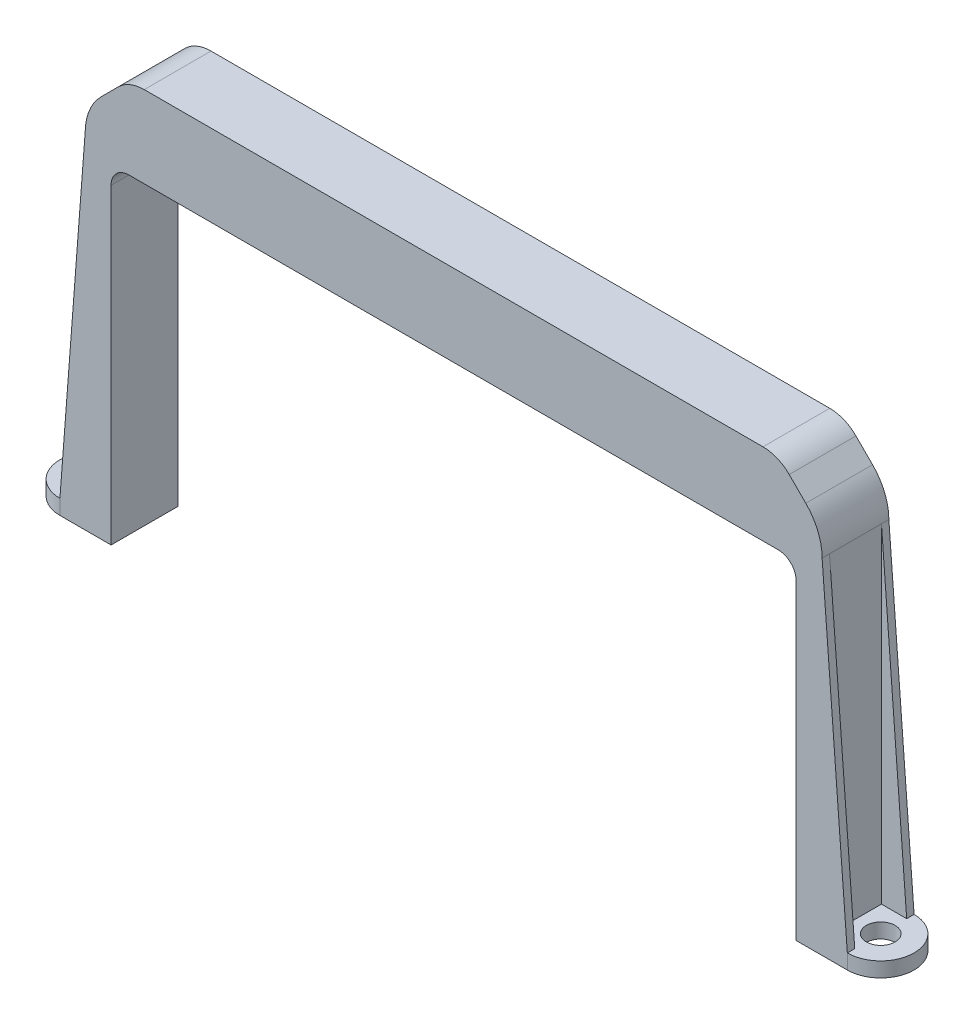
ISO-10303-21;
HEADER;
FILE_DESCRIPTION(('STEP AP214'),'2;1');
FILE_NAME('part.step','',(''),(''),'','','');
FILE_SCHEMA(('AUTOMOTIVE_DESIGN { 1 0 10303 214 1 1 1 1 }'));
ENDSEC;
DATA;
#1=APPLICATION_CONTEXT('core data for automotive mechanical design processes');
#2=APPLICATION_PROTOCOL_DEFINITION('international standard','automotive_design',2000,#1);
#3=PRODUCT_CONTEXT('',#1,'mechanical');
#4=PRODUCT('Part','Part','',(#3));
#5=PRODUCT_RELATED_PRODUCT_CATEGORY('part','',(#4));
#6=PRODUCT_DEFINITION_FORMATION('','',#4);
#7=PRODUCT_DEFINITION_CONTEXT('part definition',#1,'design');
#8=PRODUCT_DEFINITION('design','',#6,#7);
#9=PRODUCT_DEFINITION_SHAPE('','',#8);
#10=(LENGTH_UNIT() NAMED_UNIT(*) SI_UNIT(.MILLI.,.METRE.));
#11=(NAMED_UNIT(*) PLANE_ANGLE_UNIT() SI_UNIT($,.RADIAN.));
#12=(NAMED_UNIT(*) SI_UNIT($,.STERADIAN.) SOLID_ANGLE_UNIT());
#13=UNCERTAINTY_MEASURE_WITH_UNIT(LENGTH_MEASURE(1.E-05),#10,'distance_accuracy_value','');
#14=(GEOMETRIC_REPRESENTATION_CONTEXT(3) GLOBAL_UNCERTAINTY_ASSIGNED_CONTEXT((#13)) GLOBAL_UNIT_ASSIGNED_CONTEXT((#10,
#11,#12)) REPRESENTATION_CONTEXT('',''));
#15=CARTESIAN_POINT('',(0.,0.,0.));
#16=DIRECTION('',(0.,0.,1.));
#17=DIRECTION('',(1.,0.,0.));
#18=AXIS2_PLACEMENT_3D('',#15,#16,#17);
#19=CARTESIAN_POINT('',(-67.4116,-64.01944,5.715));
#20=DIRECTION('',(0.,-1.,0.));
#21=DIRECTION('',(0.,0.,-1.));
#22=AXIS2_PLACEMENT_3D('',#19,#20,#21);
#23=PLANE('',#22);
#24=CARTESIAN_POINT('',(-67.4116,-64.01944,5.715));
#25=DIRECTION('',(0.,1.,0.));
#26=DIRECTION('',(0.,0.,-1.));
#27=AXIS2_PLACEMENT_3D('',#24,#25,#26);
#28=CIRCLE('',#27,2.4638);
#29=CARTESIAN_POINT('',(-67.4116,-64.01944,3.2512));
#30=VERTEX_POINT('',#29);
#31=EDGE_CURVE('E758',#30,#30,#28,.T.);
#32=ORIENTED_EDGE('',*,*,#31,.F.);
#33=EDGE_LOOP('',(#32));
#34=FACE_BOUND('',#33,.T.);
#35=DIRECTION('',(0.,0.,1.));
#36=VECTOR('',#35,1.);
#37=CARTESIAN_POINT('',(-67.4116,-64.01944,10.16));
#38=LINE('',#37,#36);
#39=CARTESIAN_POINT('',(-67.4116,-64.01944,10.16));
#40=VERTEX_POINT('',#39);
#41=CARTESIAN_POINT('',(-67.4116,-64.01944,11.43));
#42=VERTEX_POINT('',#41);
#43=EDGE_CURVE('E718',#40,#42,#38,.T.);
#44=ORIENTED_EDGE('',*,*,#43,.F.);
#45=DIRECTION('',(-1.,0.,0.));
#46=VECTOR('',#45,1.);
#47=CARTESIAN_POINT('',(-63.0936,-64.01944,10.16));
#48=LINE('',#47,#46);
#49=CARTESIAN_POINT('',(-63.0936,-64.01944,10.16));
#50=VERTEX_POINT('',#49);
#51=EDGE_CURVE('E704',#50,#40,#48,.T.);
#52=ORIENTED_EDGE('',*,*,#51,.F.);
#53=DIRECTION('',(0.,0.,-1.));
#54=VECTOR('',#53,1.);
#55=CARTESIAN_POINT('',(-63.0936,-64.01944,11.43));
#56=LINE('',#55,#54);
#57=CARTESIAN_POINT('',(-63.0936,-64.01944,1.27));
#58=VERTEX_POINT('',#57);
#59=EDGE_CURVE('E766',#50,#58,#56,.T.);
#60=ORIENTED_EDGE('',*,*,#59,.T.);
#61=DIRECTION('',(1.,0.,0.));
#62=VECTOR('',#61,1.);
#63=CARTESIAN_POINT('',(-67.4116,-64.01944,1.27));
#64=LINE('',#63,#62);
#65=CARTESIAN_POINT('',(-67.4116,-64.01944,1.27));
#66=VERTEX_POINT('',#65);
#67=EDGE_CURVE('E743',#66,#58,#64,.T.);
#68=ORIENTED_EDGE('',*,*,#67,.F.);
#69=DIRECTION('',(0.,0.,-1.));
#70=VECTOR('',#69,1.);
#71=CARTESIAN_POINT('',(-67.4116,-64.01944,1.27));
#72=LINE('',#71,#70);
#73=CARTESIAN_POINT('',(-67.4116,-64.01944,0.));
#74=VERTEX_POINT('',#73);
#75=EDGE_CURVE('E751',#66,#74,#72,.T.);
#76=ORIENTED_EDGE('',*,*,#75,.T.);
#77=CARTESIAN_POINT('',(-67.4116,-64.01944,5.715));
#78=DIRECTION('',(0.,1.,0.));
#79=DIRECTION('',(0.,0.,-1.));
#80=AXIS2_PLACEMENT_3D('',#77,#78,#79);
#81=CIRCLE('',#80,5.715);
#82=EDGE_CURVE('E727',#74,#42,#81,.T.);
#83=ORIENTED_EDGE('',*,*,#82,.T.);
#84=EDGE_LOOP('',(#44,#52,#60,#68,#76,#83));
#85=FACE_BOUND('',#84,.T.);
#86=ADVANCED_FACE('F45',(#34,#85),#23,.F.);
#87=CARTESIAN_POINT('',(-63.0936,-66.55944,-70.7672462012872));
#88=DIRECTION('',(1.,0.,0.));
#89=DIRECTION('',(0.,1.,0.));
#90=AXIS2_PLACEMENT_3D('',#87,#88,#89);
#91=PLANE('',#90);
#92=ORIENTED_EDGE('',*,*,#59,.F.);
#93=DIRECTION('',(0.,-1.,0.));
#94=VECTOR('',#93,1.);
#95=CARTESIAN_POINT('',(-63.0936,-7.62838418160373,10.16));
#96=LINE('',#95,#94);
#97=CARTESIAN_POINT('',(-63.0936,-7.62838418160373,10.16));
#98=VERTEX_POINT('',#97);
#99=EDGE_CURVE('E710',#98,#50,#96,.T.);
#100=ORIENTED_EDGE('',*,*,#99,.F.);
#101=DIRECTION('',(0.,0.,1.));
#102=VECTOR('',#101,1.);
#103=CARTESIAN_POINT('',(-63.0936,-7.62838418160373,-70.7672462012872));
#104=LINE('',#103,#102);
#105=CARTESIAN_POINT('',(-63.0936,-7.62838418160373,1.26999999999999));
#106=VERTEX_POINT('',#105);
#107=EDGE_CURVE('E792',#106,#98,#104,.T.);
#108=ORIENTED_EDGE('',*,*,#107,.F.);
#109=DIRECTION('',(0.,1.,0.));
#110=VECTOR('',#109,1.);
#111=CARTESIAN_POINT('',(-63.0936,-64.01944,1.27));
#112=LINE('',#111,#110);
#113=EDGE_CURVE('E739',#58,#106,#112,.T.);
#114=ORIENTED_EDGE('',*,*,#113,.F.);
#115=EDGE_LOOP('',(#92,#100,#108,#114));
#116=FACE_BOUND('',#115,.T.);
#117=ADVANCED_FACE('F1741',(#116),#91,.F.);
#118=CARTESIAN_POINT('',(63.0936,-66.55944,-70.7672462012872));
#119=DIRECTION('',(1.,0.,0.));
#120=DIRECTION('',(0.,1.,0.));
#121=AXIS2_PLACEMENT_3D('',#118,#119,#120);
#122=PLANE('',#121);
#123=DIRECTION('',(0.,-1.,0.));
#124=VECTOR('',#123,1.);
#125=CARTESIAN_POINT('',(63.0936,-7.62838418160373,10.16));
#126=LINE('',#125,#124);
#127=CARTESIAN_POINT('',(63.0936,-7.62838418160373,10.16));
#128=VERTEX_POINT('',#127);
#129=CARTESIAN_POINT('',(63.0936,-64.01944,10.16));
#130=VERTEX_POINT('',#129);
#131=EDGE_CURVE('E839',#128,#130,#126,.T.);
#132=ORIENTED_EDGE('',*,*,#131,.T.);
#133=DIRECTION('',(0.,0.,-1.));
#134=VECTOR('',#133,1.);
#135=CARTESIAN_POINT('',(63.0936,-64.01944,11.43));
#136=LINE('',#135,#134);
#137=CARTESIAN_POINT('',(63.0936,-64.01944,1.27));
#138=VERTEX_POINT('',#137);
#139=EDGE_CURVE('E884',#130,#138,#136,.T.);
#140=ORIENTED_EDGE('',*,*,#139,.T.);
#141=DIRECTION('',(0.,1.,0.));
#142=VECTOR('',#141,1.);
#143=CARTESIAN_POINT('',(63.0936,-64.01944,1.27));
#144=LINE('',#143,#142);
#145=CARTESIAN_POINT('',(63.0936,-7.62838418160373,1.27));
#146=VERTEX_POINT('',#145);
#147=EDGE_CURVE('E858',#138,#146,#144,.T.);
#148=ORIENTED_EDGE('',*,*,#147,.T.);
#149=DIRECTION('',(0.,0.,1.));
#150=VECTOR('',#149,1.);
#151=CARTESIAN_POINT('',(63.0936,-7.62838418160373,-70.7672462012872));
#152=LINE('',#151,#150);
#153=EDGE_CURVE('E942',#146,#128,#152,.T.);
#154=ORIENTED_EDGE('',*,*,#153,.T.);
#155=EDGE_LOOP('',(#132,#140,#148,#154));
#156=FACE_BOUND('',#155,.T.);
#157=ADVANCED_FACE('F1747',(#156),#122,.T.);
#158=CARTESIAN_POINT('',(55.6006,0.,11.43));
#159=DIRECTION('',(0.,1.,0.));
#160=DIRECTION('',(-1.,0.,0.));
#161=AXIS2_PLACEMENT_3D('',#158,#159,#160);
#162=PLANE('',#161);
#163=DIRECTION('',(-1.,0.,0.));
#164=VECTOR('',#163,1.);
#165=CARTESIAN_POINT('',(55.6006,0.,8.89));
#166=LINE('',#165,#164);
#167=CARTESIAN_POINT('',(-35.2806,0.,8.89));
#168=VERTEX_POINT('',#167);
#169=CARTESIAN_POINT('',(-45.9994,0.,8.89));
#170=VERTEX_POINT('',#169);
#171=EDGE_CURVE('E955',#168,#170,#166,.T.);
#172=ORIENTED_EDGE('',*,*,#171,.T.);
#173=DIRECTION('',(0.,0.,-1.));
#174=VECTOR('',#173,1.);
#175=CARTESIAN_POINT('',(-45.9994,0.,22.2808847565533));
#176=LINE('',#175,#174);
#177=CARTESIAN_POINT('',(-45.9994,0.,0.));
#178=VERTEX_POINT('',#177);
#179=EDGE_CURVE('E1136',#170,#178,#176,.T.);
#180=ORIENTED_EDGE('',*,*,#179,.T.);
#181=DIRECTION('',(1.,0.,0.));
#182=VECTOR('',#181,1.);
#183=CARTESIAN_POINT('',(55.6006,0.,0.));
#184=LINE('',#183,#182);
#185=CARTESIAN_POINT('',(-35.2806,0.,0.));
#186=VERTEX_POINT('',#185);
#187=EDGE_CURVE('E1531',#178,#186,#184,.T.);
#188=ORIENTED_EDGE('',*,*,#187,.T.);
#189=DIRECTION('',(0.,0.,-1.));
#190=VECTOR('',#189,1.);
#191=CARTESIAN_POINT('',(-35.2806,0.,22.2808847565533));
#192=LINE('',#191,#190);
#193=EDGE_CURVE('E1167',#168,#186,#192,.T.);
#194=ORIENTED_EDGE('',*,*,#193,.F.);
#195=EDGE_LOOP('',(#172,#180,#188,#194));
#196=FACE_BOUND('',#195,.T.);
#197=ADVANCED_FACE('F1714',(#196),#162,.F.);
#198=CARTESIAN_POINT('',(-49.8094,0.,8.89));
#199=VERTEX_POINT('',#198);
#200=CARTESIAN_POINT('',(-51.7906,0.,8.89));
#201=VERTEX_POINT('',#200);
#202=EDGE_CURVE('E951',#199,#201,#166,.T.);
#203=ORIENTED_EDGE('',*,*,#202,.T.);
#204=DIRECTION('',(0.,0.,-1.));
#205=VECTOR('',#204,1.);
#206=CARTESIAN_POINT('',(-51.7906,0.,22.2808847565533));
#207=LINE('',#206,#205);
#208=CARTESIAN_POINT('',(-51.7906,0.,0.));
#209=VERTEX_POINT('',#208);
#210=EDGE_CURVE('E1106',#201,#209,#207,.T.);
#211=ORIENTED_EDGE('',*,*,#210,.T.);
#212=CARTESIAN_POINT('',(-49.8094,0.,0.));
#213=VERTEX_POINT('',#212);
#214=EDGE_CURVE('E1504',#209,#213,#184,.T.);
#215=ORIENTED_EDGE('',*,*,#214,.T.);
#216=DIRECTION('',(0.,0.,-1.));
#217=VECTOR('',#216,1.);
#218=CARTESIAN_POINT('',(-49.8094,0.,22.2808847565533));
#219=LINE('',#218,#217);
#220=EDGE_CURVE('E1140',#199,#213,#219,.T.);
#221=ORIENTED_EDGE('',*,*,#220,.F.);
#222=EDGE_LOOP('',(#203,#211,#215,#221));
#223=FACE_BOUND('',#222,.T.);
#224=ADVANCED_FACE('F1561',(#223),#162,.F.);
#225=CARTESIAN_POINT('',(-14.9606,0.,8.89));
#226=VERTEX_POINT('',#225);
#227=CARTESIAN_POINT('',(-25.6794,0.,8.89));
#228=VERTEX_POINT('',#227);
#229=EDGE_CURVE('E1696',#226,#228,#166,.T.);
#230=ORIENTED_EDGE('',*,*,#229,.T.);
#231=DIRECTION('',(0.,0.,-1.));
#232=VECTOR('',#231,1.);
#233=CARTESIAN_POINT('',(-25.6794,0.,22.2808847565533));
#234=LINE('',#233,#232);
#235=CARTESIAN_POINT('',(-25.6794,0.,0.));
#236=VERTEX_POINT('',#235);
#237=EDGE_CURVE('E1198',#228,#236,#234,.T.);
#238=ORIENTED_EDGE('',*,*,#237,.T.);
#239=CARTESIAN_POINT('',(-14.9606,0.,0.));
#240=VERTEX_POINT('',#239);
#241=EDGE_CURVE('E1526',#236,#240,#184,.T.);
#242=ORIENTED_EDGE('',*,*,#241,.T.);
#243=DIRECTION('',(0.,0.,-1.));
#244=VECTOR('',#243,1.);
#245=CARTESIAN_POINT('',(-14.9606,0.,22.2808847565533));
#246=LINE('',#245,#244);
#247=EDGE_CURVE('E1229',#226,#240,#246,.T.);
#248=ORIENTED_EDGE('',*,*,#247,.F.);
#249=EDGE_LOOP('',(#230,#238,#242,#248));
#250=FACE_BOUND('',#249,.T.);
#251=ADVANCED_FACE('F2553',(#250),#162,.F.);
#252=CARTESIAN_POINT('',(-29.4894,0.,8.89));
#253=VERTEX_POINT('',#252);
#254=CARTESIAN_POINT('',(-31.4706,0.,8.89));
#255=VERTEX_POINT('',#254);
#256=EDGE_CURVE('E1702',#253,#255,#166,.T.);
#257=ORIENTED_EDGE('',*,*,#256,.T.);
#258=DIRECTION('',(0.,0.,-1.));
#259=VECTOR('',#258,1.);
#260=CARTESIAN_POINT('',(-31.4706,0.,22.2808847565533));
#261=LINE('',#260,#259);
#262=CARTESIAN_POINT('',(-31.4706,0.,0.));
#263=VERTEX_POINT('',#262);
#264=EDGE_CURVE('E1166',#255,#263,#261,.T.);
#265=ORIENTED_EDGE('',*,*,#264,.T.);
#266=CARTESIAN_POINT('',(-29.4894,0.,0.));
#267=VERTEX_POINT('',#266);
#268=EDGE_CURVE('E1528',#263,#267,#184,.T.);
#269=ORIENTED_EDGE('',*,*,#268,.T.);
#270=DIRECTION('',(0.,0.,-1.));
#271=VECTOR('',#270,1.);
#272=CARTESIAN_POINT('',(-29.4894,0.,22.2808847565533));
#273=LINE('',#272,#271);
#274=EDGE_CURVE('E1202',#253,#267,#273,.T.);
#275=ORIENTED_EDGE('',*,*,#274,.F.);
#276=EDGE_LOOP('',(#257,#265,#269,#275));
#277=FACE_BOUND('',#276,.T.);
#278=ADVANCED_FACE('F2546',(#277),#162,.F.);
#279=CARTESIAN_POINT('',(5.35939999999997,0.,8.89));
#280=VERTEX_POINT('',#279);
#281=CARTESIAN_POINT('',(-5.3594,0.,8.89));
#282=VERTEX_POINT('',#281);
#283=EDGE_CURVE('E1682',#280,#282,#166,.T.);
#284=ORIENTED_EDGE('',*,*,#283,.T.);
#285=DIRECTION('',(0.,0.,-1.));
#286=VECTOR('',#285,1.);
#287=CARTESIAN_POINT('',(-5.35940000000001,0.,22.2808847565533));
#288=LINE('',#287,#286);
#289=CARTESIAN_POINT('',(-5.35940000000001,0.,0.));
#290=VERTEX_POINT('',#289);
#291=EDGE_CURVE('E1260',#282,#290,#288,.T.);
#292=ORIENTED_EDGE('',*,*,#291,.T.);
#293=CARTESIAN_POINT('',(5.35939999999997,0.,0.));
#294=VERTEX_POINT('',#293);
#295=EDGE_CURVE('E1521',#290,#294,#184,.T.);
#296=ORIENTED_EDGE('',*,*,#295,.T.);
#297=DIRECTION('',(0.,0.,-1.));
#298=VECTOR('',#297,1.);
#299=CARTESIAN_POINT('',(5.35939999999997,0.,22.2808847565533));
#300=LINE('',#299,#298);
#301=EDGE_CURVE('E1291',#280,#294,#300,.T.);
#302=ORIENTED_EDGE('',*,*,#301,.F.);
#303=EDGE_LOOP('',(#284,#292,#296,#302));
#304=FACE_BOUND('',#303,.T.);
#305=ADVANCED_FACE('F2539',(#304),#162,.F.);
#306=CARTESIAN_POINT('',(-9.16940000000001,0.,8.89));
#307=VERTEX_POINT('',#306);
#308=CARTESIAN_POINT('',(-11.1506,0.,8.89));
#309=VERTEX_POINT('',#308);
#310=EDGE_CURVE('E1689',#307,#309,#166,.T.);
#311=ORIENTED_EDGE('',*,*,#310,.T.);
#312=DIRECTION('',(0.,0.,-1.));
#313=VECTOR('',#312,1.);
#314=CARTESIAN_POINT('',(-11.1506,0.,22.2808847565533));
#315=LINE('',#314,#313);
#316=CARTESIAN_POINT('',(-11.1506,0.,0.));
#317=VERTEX_POINT('',#316);
#318=EDGE_CURVE('E1228',#309,#317,#315,.T.);
#319=ORIENTED_EDGE('',*,*,#318,.T.);
#320=CARTESIAN_POINT('',(-9.16940000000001,0.,0.));
#321=VERTEX_POINT('',#320);
#322=EDGE_CURVE('E1524',#317,#321,#184,.T.);
#323=ORIENTED_EDGE('',*,*,#322,.T.);
#324=DIRECTION('',(0.,0.,-1.));
#325=VECTOR('',#324,1.);
#326=CARTESIAN_POINT('',(-9.16940000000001,0.,22.2808847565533));
#327=LINE('',#326,#325);
#328=EDGE_CURVE('E1264',#307,#321,#327,.T.);
#329=ORIENTED_EDGE('',*,*,#328,.F.);
#330=EDGE_LOOP('',(#311,#319,#323,#329));
#331=FACE_BOUND('',#330,.T.);
#332=ADVANCED_FACE('F2532',(#331),#162,.F.);
#333=CARTESIAN_POINT('',(25.6794,0.,8.89));
#334=VERTEX_POINT('',#333);
#335=CARTESIAN_POINT('',(14.9606,0.,8.89));
#336=VERTEX_POINT('',#335);
#337=EDGE_CURVE('E1671',#334,#336,#166,.T.);
#338=ORIENTED_EDGE('',*,*,#337,.T.);
#339=DIRECTION('',(0.,0.,-1.));
#340=VECTOR('',#339,1.);
#341=CARTESIAN_POINT('',(14.9606,0.,22.2808847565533));
#342=LINE('',#341,#340);
#343=CARTESIAN_POINT('',(14.9606,0.,0.));
#344=VERTEX_POINT('',#343);
#345=EDGE_CURVE('E1322',#336,#344,#342,.T.);
#346=ORIENTED_EDGE('',*,*,#345,.T.);
#347=CARTESIAN_POINT('',(25.6794,0.,0.));
#348=VERTEX_POINT('',#347);
#349=EDGE_CURVE('E1515',#344,#348,#184,.T.);
#350=ORIENTED_EDGE('',*,*,#349,.T.);
#351=DIRECTION('',(0.,0.,-1.));
#352=VECTOR('',#351,1.);
#353=CARTESIAN_POINT('',(25.6794,0.,22.2808847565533));
#354=LINE('',#353,#352);
#355=EDGE_CURVE('E1353',#334,#348,#354,.T.);
#356=ORIENTED_EDGE('',*,*,#355,.F.);
#357=EDGE_LOOP('',(#338,#346,#350,#356));
#358=FACE_BOUND('',#357,.T.);
#359=ADVANCED_FACE('F2525',(#358),#162,.F.);
#360=CARTESIAN_POINT('',(11.1506,0.,8.89));
#361=VERTEX_POINT('',#360);
#362=CARTESIAN_POINT('',(9.16939999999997,0.,8.89));
#363=VERTEX_POINT('',#362);
#364=EDGE_CURVE('E1676',#361,#363,#166,.T.);
#365=ORIENTED_EDGE('',*,*,#364,.T.);
#366=DIRECTION('',(0.,0.,-1.));
#367=VECTOR('',#366,1.);
#368=CARTESIAN_POINT('',(9.16939999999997,0.,22.2808847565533));
#369=LINE('',#368,#367);
#370=CARTESIAN_POINT('',(9.16939999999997,0.,0.));
#371=VERTEX_POINT('',#370);
#372=EDGE_CURVE('E1290',#363,#371,#369,.T.);
#373=ORIENTED_EDGE('',*,*,#372,.T.);
#374=CARTESIAN_POINT('',(11.1506,0.,0.));
#375=VERTEX_POINT('',#374);
#376=EDGE_CURVE('E1518',#371,#375,#184,.T.);
#377=ORIENTED_EDGE('',*,*,#376,.T.);
#378=DIRECTION('',(0.,0.,-1.));
#379=VECTOR('',#378,1.);
#380=CARTESIAN_POINT('',(11.1506,0.,22.2808847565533));
#381=LINE('',#380,#379);
#382=EDGE_CURVE('E1326',#361,#375,#381,.T.);
#383=ORIENTED_EDGE('',*,*,#382,.F.);
#384=EDGE_LOOP('',(#365,#373,#377,#383));
#385=FACE_BOUND('',#384,.T.);
#386=ADVANCED_FACE('F2518',(#385),#162,.F.);
#387=CARTESIAN_POINT('',(45.9994,0.,8.89));
#388=VERTEX_POINT('',#387);
#389=CARTESIAN_POINT('',(35.2806,0.,8.89));
#390=VERTEX_POINT('',#389);
#391=EDGE_CURVE('E1663',#388,#390,#166,.T.);
#392=ORIENTED_EDGE('',*,*,#391,.T.);
#393=DIRECTION('',(0.,0.,-1.));
#394=VECTOR('',#393,1.);
#395=CARTESIAN_POINT('',(35.2806,0.,22.2808847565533));
#396=LINE('',#395,#394);
#397=CARTESIAN_POINT('',(35.2806,0.,0.));
#398=VERTEX_POINT('',#397);
#399=EDGE_CURVE('E1384',#390,#398,#396,.T.);
#400=ORIENTED_EDGE('',*,*,#399,.T.);
#401=CARTESIAN_POINT('',(45.9994,0.,0.));
#402=VERTEX_POINT('',#401);
#403=EDGE_CURVE('E1493',#398,#402,#184,.T.);
#404=ORIENTED_EDGE('',*,*,#403,.T.);
#405=DIRECTION('',(0.,0.,-1.));
#406=VECTOR('',#405,1.);
#407=CARTESIAN_POINT('',(45.9994,0.,22.2808847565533));
#408=LINE('',#407,#406);
#409=EDGE_CURVE('E1415',#388,#402,#408,.T.);
#410=ORIENTED_EDGE('',*,*,#409,.F.);
#411=EDGE_LOOP('',(#392,#400,#404,#410));
#412=FACE_BOUND('',#411,.T.);
#413=ADVANCED_FACE('F2511',(#412),#162,.F.);
#414=CARTESIAN_POINT('',(31.4706,0.,8.89));
#415=VERTEX_POINT('',#414);
#416=CARTESIAN_POINT('',(29.4894,0.,8.89));
#417=VERTEX_POINT('',#416);
#418=EDGE_CURVE('E1666',#415,#417,#166,.T.);
#419=ORIENTED_EDGE('',*,*,#418,.T.);
#420=DIRECTION('',(0.,0.,-1.));
#421=VECTOR('',#420,1.);
#422=CARTESIAN_POINT('',(29.4894,0.,22.2808847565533));
#423=LINE('',#422,#421);
#424=CARTESIAN_POINT('',(29.4894,0.,0.));
#425=VERTEX_POINT('',#424);
#426=EDGE_CURVE('E1352',#417,#425,#423,.T.);
#427=ORIENTED_EDGE('',*,*,#426,.T.);
#428=CARTESIAN_POINT('',(31.4706,0.,0.));
#429=VERTEX_POINT('',#428);
#430=EDGE_CURVE('E1512',#425,#429,#184,.T.);
#431=ORIENTED_EDGE('',*,*,#430,.T.);
#432=DIRECTION('',(0.,0.,-1.));
#433=VECTOR('',#432,1.);
#434=CARTESIAN_POINT('',(31.4706,0.,22.2808847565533));
#435=LINE('',#434,#433);
#436=EDGE_CURVE('E1388',#415,#429,#435,.T.);
#437=ORIENTED_EDGE('',*,*,#436,.F.);
#438=EDGE_LOOP('',(#419,#427,#431,#437));
#439=FACE_BOUND('',#438,.T.);
#440=ADVANCED_FACE('F2504',(#439),#162,.F.);
#441=CARTESIAN_POINT('',(51.7906,0.,8.89));
#442=VERTEX_POINT('',#441);
#443=CARTESIAN_POINT('',(49.8094,0.,8.89));
#444=VERTEX_POINT('',#443);
#445=EDGE_CURVE('E956',#442,#444,#166,.T.);
#446=ORIENTED_EDGE('',*,*,#445,.T.);
#447=DIRECTION('',(0.,0.,-1.));
#448=VECTOR('',#447,1.);
#449=CARTESIAN_POINT('',(49.8094,0.,22.2808847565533));
#450=LINE('',#449,#448);
#451=CARTESIAN_POINT('',(49.8094,0.,0.));
#452=VERTEX_POINT('',#451);
#453=EDGE_CURVE('E1414',#444,#452,#450,.T.);
#454=ORIENTED_EDGE('',*,*,#453,.T.);
#455=CARTESIAN_POINT('',(51.7906,0.,0.));
#456=VERTEX_POINT('',#455);
#457=EDGE_CURVE('E1488',#452,#456,#184,.T.);
#458=ORIENTED_EDGE('',*,*,#457,.T.);
#459=DIRECTION('',(0.,0.,-1.));
#460=VECTOR('',#459,1.);
#461=CARTESIAN_POINT('',(51.7906,0.,22.2808847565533));
#462=LINE('',#461,#460);
#463=EDGE_CURVE('E1443',#442,#456,#462,.T.);
#464=ORIENTED_EDGE('',*,*,#463,.F.);
#465=EDGE_LOOP('',(#446,#454,#458,#464));
#466=FACE_BOUND('',#465,.T.);
#467=ADVANCED_FACE('F1641',(#466),#162,.F.);
#468=CARTESIAN_POINT('',(51.7906,0.,22.2808847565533));
#469=DIRECTION('',(-1.,0.,0.));
#470=DIRECTION('',(0.,0.,1.));
#471=AXIS2_PLACEMENT_3D('',#468,#469,#470);
#472=PLANE('',#471);
#473=DIRECTION('',(0.,0.,-1.));
#474=VECTOR('',#473,1.);
#475=CARTESIAN_POINT('',(51.7906,-6.98500000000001,22.2808847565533));
#476=LINE('',#475,#474);
#477=CARTESIAN_POINT('',(51.7906,-6.98500000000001,8.89));
#478=VERTEX_POINT('',#477);
#479=CARTESIAN_POINT('',(51.7906,-6.98500000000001,0.));
#480=VERTEX_POINT('',#479);
#481=EDGE_CURVE('E1440',#478,#480,#476,.T.);
#482=ORIENTED_EDGE('',*,*,#481,.F.);
#483=DIRECTION('',(0.,1.,0.));
#484=VECTOR('',#483,1.);
#485=CARTESIAN_POINT('',(51.7906,0.,8.89));
#486=LINE('',#485,#484);
#487=EDGE_CURVE('E1091',#478,#442,#486,.T.);
#488=ORIENTED_EDGE('',*,*,#487,.T.);
#489=ORIENTED_EDGE('',*,*,#463,.T.);
#490=DIRECTION('',(0.,1.,0.));
#491=VECTOR('',#490,1.);
#492=CARTESIAN_POINT('',(51.7906,0.,0.));
#493=LINE('',#492,#491);
#494=EDGE_CURVE('E1437',#480,#456,#493,.T.);
#495=ORIENTED_EDGE('',*,*,#494,.F.);
#496=EDGE_LOOP('',(#482,#488,#489,#495));
#497=FACE_BOUND('',#496,.T.);
#498=ADVANCED_FACE('F1661',(#497),#472,.T.);
#499=CARTESIAN_POINT('',(52.6413386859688,-10.16,22.2808847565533));
#500=DIRECTION('',(-0.965925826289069,-0.258819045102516,0.));
#501=DIRECTION('',(0.258819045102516,-0.96592582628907,0.));
#502=AXIS2_PLACEMENT_3D('',#499,#500,#501);
#503=PLANE('',#502);
#504=DIRECTION('',(0.,0.,-1.));
#505=VECTOR('',#504,1.);
#506=CARTESIAN_POINT('',(52.6413386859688,-10.16,22.2808847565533));
#507=LINE('',#506,#505);
#508=CARTESIAN_POINT('',(52.6413386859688,-10.16,8.89));
#509=VERTEX_POINT('',#508);
#510=CARTESIAN_POINT('',(52.6413386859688,-10.16,0.));
#511=VERTEX_POINT('',#510);
#512=EDGE_CURVE('E1652',#509,#511,#507,.T.);
#513=ORIENTED_EDGE('',*,*,#512,.F.);
#514=DIRECTION('',(-0.258819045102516,0.96592582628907,0.));
#515=VECTOR('',#514,1.);
#516=CARTESIAN_POINT('',(52.6413386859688,-10.16,8.89));
#517=LINE('',#516,#515);
#518=EDGE_CURVE('E1087',#509,#478,#517,.T.);
#519=ORIENTED_EDGE('',*,*,#518,.T.);
#520=ORIENTED_EDGE('',*,*,#481,.T.);
#521=DIRECTION('',(-0.258819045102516,0.965925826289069,0.));
#522=VECTOR('',#521,1.);
#523=CARTESIAN_POINT('',(52.6413386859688,-10.16,0.));
#524=LINE('',#523,#522);
#525=EDGE_CURVE('E1433',#511,#480,#524,.T.);
#526=ORIENTED_EDGE('',*,*,#525,.F.);
#527=EDGE_LOOP('',(#513,#519,#520,#526));
#528=FACE_BOUND('',#527,.T.);
#529=ADVANCED_FACE('F1660',(#528),#503,.T.);
#530=CARTESIAN_POINT('',(45.9994,0.,22.2808847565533));
#531=DIRECTION('',(-1.,0.,0.));
#532=DIRECTION('',(0.,-1.,0.));
#533=AXIS2_PLACEMENT_3D('',#530,#531,#532);
#534=PLANE('',#533);
#535=DIRECTION('',(0.,0.,-1.));
#536=VECTOR('',#535,1.);
#537=CARTESIAN_POINT('',(45.9994,-10.16,22.2808847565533));
#538=LINE('',#537,#536);
#539=CARTESIAN_POINT('',(45.9994,-10.16,8.89));
#540=VERTEX_POINT('',#539);
#541=CARTESIAN_POINT('',(45.9994,-10.16,0.));
#542=VERTEX_POINT('',#541);
#543=EDGE_CURVE('E1419',#540,#542,#538,.T.);
#544=ORIENTED_EDGE('',*,*,#543,.F.);
#545=DIRECTION('',(0.,1.,0.));
#546=VECTOR('',#545,1.);
#547=CARTESIAN_POINT('',(45.9994,0.,8.89));
#548=LINE('',#547,#546);
#549=EDGE_CURVE('E1083',#540,#388,#548,.T.);
#550=ORIENTED_EDGE('',*,*,#549,.T.);
#551=ORIENTED_EDGE('',*,*,#409,.T.);
#552=DIRECTION('',(0.,1.,0.));
#553=VECTOR('',#552,1.);
#554=CARTESIAN_POINT('',(45.9994,0.,0.));
#555=LINE('',#554,#553);
#556=EDGE_CURVE('E1410',#542,#402,#555,.T.);
#557=ORIENTED_EDGE('',*,*,#556,.F.);
#558=EDGE_LOOP('',(#544,#550,#551,#557));
#559=FACE_BOUND('',#558,.T.);
#560=ADVANCED_FACE('F1621',(#559),#534,.T.);
#561=CARTESIAN_POINT('',(48.9586613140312,-10.16,22.2808847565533));
#562=DIRECTION('',(0.965925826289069,-0.258819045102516,0.));
#563=DIRECTION('',(0.258819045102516,0.96592582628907,0.));
#564=AXIS2_PLACEMENT_3D('',#561,#562,#563);
#565=PLANE('',#564);
#566=DIRECTION('',(0.,0.,-1.));
#567=VECTOR('',#566,1.);
#568=CARTESIAN_POINT('',(49.8094,-6.98500000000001,22.2808847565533));
#569=LINE('',#568,#567);
#570=CARTESIAN_POINT('',(49.8094,-6.98500000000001,8.89));
#571=VERTEX_POINT('',#570);
#572=CARTESIAN_POINT('',(49.8094,-6.98500000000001,0.));
#573=VERTEX_POINT('',#572);
#574=EDGE_CURVE('E1425',#571,#573,#569,.T.);
#575=ORIENTED_EDGE('',*,*,#574,.F.);
#576=DIRECTION('',(-0.258819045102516,-0.96592582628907,0.));
#577=VECTOR('',#576,1.);
#578=CARTESIAN_POINT('',(48.9586613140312,-10.16,8.89));
#579=LINE('',#578,#577);
#580=CARTESIAN_POINT('',(48.9586613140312,-10.16,8.89));
#581=VERTEX_POINT('',#580);
#582=EDGE_CURVE('E1079',#571,#581,#579,.T.);
#583=ORIENTED_EDGE('',*,*,#582,.T.);
#584=DIRECTION('',(0.,0.,-1.));
#585=VECTOR('',#584,1.);
#586=CARTESIAN_POINT('',(48.9586613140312,-10.16,22.2808847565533));
#587=LINE('',#586,#585);
#588=CARTESIAN_POINT('',(48.9586613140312,-10.16,0.));
#589=VERTEX_POINT('',#588);
#590=EDGE_CURVE('E1422',#581,#589,#587,.T.);
#591=ORIENTED_EDGE('',*,*,#590,.T.);
#592=DIRECTION('',(-0.258819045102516,-0.965925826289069,0.));
#593=VECTOR('',#592,1.);
#594=CARTESIAN_POINT('',(48.9586613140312,-10.16,0.));
#595=LINE('',#594,#593);
#596=EDGE_CURVE('E1402',#573,#589,#595,.T.);
#597=ORIENTED_EDGE('',*,*,#596,.F.);
#598=EDGE_LOOP('',(#575,#583,#591,#597));
#599=FACE_BOUND('',#598,.T.);
#600=ADVANCED_FACE('F1631',(#599),#565,.T.);
#601=CARTESIAN_POINT('',(49.8094,0.,22.2808847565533));
#602=DIRECTION('',(1.,0.,0.));
#603=DIRECTION('',(0.,0.,-1.));
#604=AXIS2_PLACEMENT_3D('',#601,#602,#603);
#605=PLANE('',#604);
#606=ORIENTED_EDGE('',*,*,#453,.F.);
#607=DIRECTION('',(0.,-1.,0.));
#608=VECTOR('',#607,1.);
#609=CARTESIAN_POINT('',(49.8094,0.,8.89));
#610=LINE('',#609,#608);
#611=EDGE_CURVE('E1075',#444,#571,#610,.T.);
#612=ORIENTED_EDGE('',*,*,#611,.T.);
#613=ORIENTED_EDGE('',*,*,#574,.T.);
#614=DIRECTION('',(0.,-1.,0.));
#615=VECTOR('',#614,1.);
#616=CARTESIAN_POINT('',(49.8094,0.,0.));
#617=LINE('',#616,#615);
#618=EDGE_CURVE('E1387',#452,#573,#617,.T.);
#619=ORIENTED_EDGE('',*,*,#618,.F.);
#620=EDGE_LOOP('',(#606,#612,#613,#619));
#621=FACE_BOUND('',#620,.T.);
#622=ADVANCED_FACE('F1637',(#621),#605,.T.);
#623=CARTESIAN_POINT('',(35.2806,0.,22.2808847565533));
#624=DIRECTION('',(1.,0.,0.));
#625=DIRECTION('',(0.,1.,0.));
#626=AXIS2_PLACEMENT_3D('',#623,#624,#625);
#627=PLANE('',#626);
#628=ORIENTED_EDGE('',*,*,#399,.F.);
#629=DIRECTION('',(0.,-1.,0.));
#630=VECTOR('',#629,1.);
#631=CARTESIAN_POINT('',(35.2806,0.,8.89));
#632=LINE('',#631,#630);
#633=CARTESIAN_POINT('',(35.2806,-10.16,8.89));
#634=VERTEX_POINT('',#633);
#635=EDGE_CURVE('E1071',#390,#634,#632,.T.);
#636=ORIENTED_EDGE('',*,*,#635,.T.);
#637=DIRECTION('',(0.,0.,-1.));
#638=VECTOR('',#637,1.);
#639=CARTESIAN_POINT('',(35.2806,-10.16,22.2808847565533));
#640=LINE('',#639,#638);
#641=CARTESIAN_POINT('',(35.2806,-10.16,0.));
#642=VERTEX_POINT('',#641);
#643=EDGE_CURVE('E1383',#634,#642,#640,.T.);
#644=ORIENTED_EDGE('',*,*,#643,.T.);
#645=DIRECTION('',(0.,-1.,0.));
#646=VECTOR('',#645,1.);
#647=CARTESIAN_POINT('',(35.2806,0.,0.));
#648=LINE('',#647,#646);
#649=EDGE_CURVE('E1356',#398,#642,#648,.T.);
#650=ORIENTED_EDGE('',*,*,#649,.F.);
#651=EDGE_LOOP('',(#628,#636,#644,#650));
#652=FACE_BOUND('',#651,.T.);
#653=ADVANCED_FACE('F1893',(#652),#627,.T.);
#654=CARTESIAN_POINT('',(31.4706,0.,22.2808847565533));
#655=DIRECTION('',(-1.,0.,0.));
#656=DIRECTION('',(0.,0.,1.));
#657=AXIS2_PLACEMENT_3D('',#654,#655,#656);
#658=PLANE('',#657);
#659=DIRECTION('',(0.,0.,-1.));
#660=VECTOR('',#659,1.);
#661=CARTESIAN_POINT('',(31.4706,-6.98500000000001,22.2808847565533));
#662=LINE('',#661,#660);
#663=CARTESIAN_POINT('',(31.4706,-6.98500000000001,8.89));
#664=VERTEX_POINT('',#663);
#665=CARTESIAN_POINT('',(31.4706,-6.98500000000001,0.));
#666=VERTEX_POINT('',#665);
#667=EDGE_CURVE('E1391',#664,#666,#662,.T.);
#668=ORIENTED_EDGE('',*,*,#667,.F.);
#669=DIRECTION('',(0.,1.,0.));
#670=VECTOR('',#669,1.);
#671=CARTESIAN_POINT('',(31.4706,0.,8.89));
#672=LINE('',#671,#670);
#673=EDGE_CURVE('E1067',#664,#415,#672,.T.);
#674=ORIENTED_EDGE('',*,*,#673,.T.);
#675=ORIENTED_EDGE('',*,*,#436,.T.);
#676=DIRECTION('',(0.,1.,0.));
#677=VECTOR('',#676,1.);
#678=CARTESIAN_POINT('',(31.4706,0.,0.));
#679=LINE('',#678,#677);
#680=EDGE_CURVE('E1379',#666,#429,#679,.T.);
#681=ORIENTED_EDGE('',*,*,#680,.F.);
#682=EDGE_LOOP('',(#668,#674,#675,#681));
#683=FACE_BOUND('',#682,.T.);
#684=ADVANCED_FACE('F1900',(#683),#658,.T.);
#685=CARTESIAN_POINT('',(32.3213386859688,-10.16,22.2808847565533));
#686=DIRECTION('',(-0.965925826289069,-0.258819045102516,0.));
#687=DIRECTION('',(0.258819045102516,-0.96592582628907,0.));
#688=AXIS2_PLACEMENT_3D('',#685,#686,#687);
#689=PLANE('',#688);
#690=DIRECTION('',(0.,0.,-1.));
#691=VECTOR('',#690,1.);
#692=CARTESIAN_POINT('',(32.3213386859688,-10.16,22.2808847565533));
#693=LINE('',#692,#691);
#694=CARTESIAN_POINT('',(32.3213386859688,-10.16,8.89));
#695=VERTEX_POINT('',#694);
#696=CARTESIAN_POINT('',(32.3213386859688,-10.16,0.));
#697=VERTEX_POINT('',#696);
#698=EDGE_CURVE('E1394',#695,#697,#693,.T.);
#699=ORIENTED_EDGE('',*,*,#698,.F.);
#700=DIRECTION('',(-0.258819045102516,0.96592582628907,0.));
#701=VECTOR('',#700,1.);
#702=CARTESIAN_POINT('',(32.3213386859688,-10.16,8.89));
#703=LINE('',#702,#701);
#704=EDGE_CURVE('E1063',#695,#664,#703,.T.);
#705=ORIENTED_EDGE('',*,*,#704,.T.);
#706=ORIENTED_EDGE('',*,*,#667,.T.);
#707=DIRECTION('',(-0.258819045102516,0.965925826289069,0.));
#708=VECTOR('',#707,1.);
#709=CARTESIAN_POINT('',(32.3213386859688,-10.16,0.));
#710=LINE('',#709,#708);
#711=EDGE_CURVE('E1375',#697,#666,#710,.T.);
#712=ORIENTED_EDGE('',*,*,#711,.F.);
#713=EDGE_LOOP('',(#699,#705,#706,#712));
#714=FACE_BOUND('',#713,.T.);
#715=ADVANCED_FACE('F1902',(#714),#689,.T.);
#716=CARTESIAN_POINT('',(25.6794,0.,22.2808847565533));
#717=DIRECTION('',(-1.,0.,0.));
#718=DIRECTION('',(0.,-1.,0.));
#719=AXIS2_PLACEMENT_3D('',#716,#717,#718);
#720=PLANE('',#719);
#721=DIRECTION('',(0.,0.,-1.));
#722=VECTOR('',#721,1.);
#723=CARTESIAN_POINT('',(25.6794,-10.16,22.2808847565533));
#724=LINE('',#723,#722);
#725=CARTESIAN_POINT('',(25.6794,-10.16,8.89));
#726=VERTEX_POINT('',#725);
#727=CARTESIAN_POINT('',(25.6794,-10.16,0.));
#728=VERTEX_POINT('',#727);
#729=EDGE_CURVE('E1357',#726,#728,#724,.T.);
#730=ORIENTED_EDGE('',*,*,#729,.F.);
#731=DIRECTION('',(0.,1.,0.));
#732=VECTOR('',#731,1.);
#733=CARTESIAN_POINT('',(25.6794,0.,8.89));
#734=LINE('',#733,#732);
#735=EDGE_CURVE('E1059',#726,#334,#734,.T.);
#736=ORIENTED_EDGE('',*,*,#735,.T.);
#737=ORIENTED_EDGE('',*,*,#355,.T.);
#738=DIRECTION('',(0.,1.,0.));
#739=VECTOR('',#738,1.);
#740=CARTESIAN_POINT('',(25.6794,0.,0.));
#741=LINE('',#740,#739);
#742=EDGE_CURVE('E1348',#728,#348,#741,.T.);
#743=ORIENTED_EDGE('',*,*,#742,.F.);
#744=EDGE_LOOP('',(#730,#736,#737,#743));
#745=FACE_BOUND('',#744,.T.);
#746=ADVANCED_FACE('F1905',(#745),#720,.T.);
#747=CARTESIAN_POINT('',(28.6386613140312,-10.16,22.2808847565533));
#748=DIRECTION('',(0.965925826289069,-0.258819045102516,0.));
#749=DIRECTION('',(0.258819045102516,0.96592582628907,0.));
#750=AXIS2_PLACEMENT_3D('',#747,#748,#749);
#751=PLANE('',#750);
#752=DIRECTION('',(0.,0.,-1.));
#753=VECTOR('',#752,1.);
#754=CARTESIAN_POINT('',(29.4894,-6.98500000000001,22.2808847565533));
#755=LINE('',#754,#753);
#756=CARTESIAN_POINT('',(29.4894,-6.98500000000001,8.89));
#757=VERTEX_POINT('',#756);
#758=CARTESIAN_POINT('',(29.4894,-6.98500000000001,0.));
#759=VERTEX_POINT('',#758);
#760=EDGE_CURVE('E1363',#757,#759,#755,.T.);
#761=ORIENTED_EDGE('',*,*,#760,.F.);
#762=DIRECTION('',(-0.258819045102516,-0.96592582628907,0.));
#763=VECTOR('',#762,1.);
#764=CARTESIAN_POINT('',(28.6386613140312,-10.16,8.89));
#765=LINE('',#764,#763);
#766=CARTESIAN_POINT('',(28.6386613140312,-10.16,8.89));
#767=VERTEX_POINT('',#766);
#768=EDGE_CURVE('E1055',#757,#767,#765,.T.);
#769=ORIENTED_EDGE('',*,*,#768,.T.);
#770=DIRECTION('',(0.,0.,-1.));
#771=VECTOR('',#770,1.);
#772=CARTESIAN_POINT('',(28.6386613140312,-10.16,22.2808847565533));
#773=LINE('',#772,#771);
#774=CARTESIAN_POINT('',(28.6386613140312,-10.16,0.));
#775=VERTEX_POINT('',#774);
#776=EDGE_CURVE('E1360',#767,#775,#773,.T.);
#777=ORIENTED_EDGE('',*,*,#776,.T.);
#778=DIRECTION('',(-0.258819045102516,-0.965925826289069,0.));
#779=VECTOR('',#778,1.);
#780=CARTESIAN_POINT('',(28.6386613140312,-10.16,0.));
#781=LINE('',#780,#779);
#782=EDGE_CURVE('E1340',#759,#775,#781,.T.);
#783=ORIENTED_EDGE('',*,*,#782,.F.);
#784=EDGE_LOOP('',(#761,#769,#777,#783));
#785=FACE_BOUND('',#784,.T.);
#786=ADVANCED_FACE('F1914',(#785),#751,.T.);
#787=CARTESIAN_POINT('',(29.4894,0.,22.2808847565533));
#788=DIRECTION('',(1.,0.,0.));
#789=DIRECTION('',(0.,0.,-1.));
#790=AXIS2_PLACEMENT_3D('',#787,#788,#789);
#791=PLANE('',#790);
#792=ORIENTED_EDGE('',*,*,#426,.F.);
#793=DIRECTION('',(0.,-1.,0.));
#794=VECTOR('',#793,1.);
#795=CARTESIAN_POINT('',(29.4894,0.,8.89));
#796=LINE('',#795,#794);
#797=EDGE_CURVE('E1051',#417,#757,#796,.T.);
#798=ORIENTED_EDGE('',*,*,#797,.T.);
#799=ORIENTED_EDGE('',*,*,#760,.T.);
#800=DIRECTION('',(0.,-1.,0.));
#801=VECTOR('',#800,1.);
#802=CARTESIAN_POINT('',(29.4894,0.,0.));
#803=LINE('',#802,#801);
#804=EDGE_CURVE('E1325',#425,#759,#803,.T.);
#805=ORIENTED_EDGE('',*,*,#804,.F.);
#806=EDGE_LOOP('',(#792,#798,#799,#805));
#807=FACE_BOUND('',#806,.T.);
#808=ADVANCED_FACE('F1910',(#807),#791,.T.);
#809=CARTESIAN_POINT('',(14.9606,0.,22.2808847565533));
#810=DIRECTION('',(1.,0.,0.));
#811=DIRECTION('',(0.,1.,0.));
#812=AXIS2_PLACEMENT_3D('',#809,#810,#811);
#813=PLANE('',#812);
#814=ORIENTED_EDGE('',*,*,#345,.F.);
#815=DIRECTION('',(0.,-1.,0.));
#816=VECTOR('',#815,1.);
#817=CARTESIAN_POINT('',(14.9606,0.,8.89));
#818=LINE('',#817,#816);
#819=CARTESIAN_POINT('',(14.9606,-10.16,8.89));
#820=VERTEX_POINT('',#819);
#821=EDGE_CURVE('E1047',#336,#820,#818,.T.);
#822=ORIENTED_EDGE('',*,*,#821,.T.);
#823=DIRECTION('',(0.,0.,-1.));
#824=VECTOR('',#823,1.);
#825=CARTESIAN_POINT('',(14.9606,-10.16,22.2808847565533));
#826=LINE('',#825,#824);
#827=CARTESIAN_POINT('',(14.9606,-10.16,0.));
#828=VERTEX_POINT('',#827);
#829=EDGE_CURVE('E1321',#820,#828,#826,.T.);
#830=ORIENTED_EDGE('',*,*,#829,.T.);
#831=DIRECTION('',(0.,-1.,0.));
#832=VECTOR('',#831,1.);
#833=CARTESIAN_POINT('',(14.9606,0.,0.));
#834=LINE('',#833,#832);
#835=EDGE_CURVE('E1294',#344,#828,#834,.T.);
#836=ORIENTED_EDGE('',*,*,#835,.F.);
#837=EDGE_LOOP('',(#814,#822,#830,#836));
#838=FACE_BOUND('',#837,.T.);
#839=ADVANCED_FACE('F1913',(#838),#813,.T.);
#840=CARTESIAN_POINT('',(11.1506,0.,22.2808847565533));
#841=DIRECTION('',(-1.,0.,0.));
#842=DIRECTION('',(0.,0.,1.));
#843=AXIS2_PLACEMENT_3D('',#840,#841,#842);
#844=PLANE('',#843);
#845=DIRECTION('',(0.,0.,-1.));
#846=VECTOR('',#845,1.);
#847=CARTESIAN_POINT('',(11.1506,-6.98500000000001,22.2808847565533));
#848=LINE('',#847,#846);
#849=CARTESIAN_POINT('',(11.1506,-6.98500000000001,8.89));
#850=VERTEX_POINT('',#849);
#851=CARTESIAN_POINT('',(11.1506,-6.98500000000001,0.));
#852=VERTEX_POINT('',#851);
#853=EDGE_CURVE('E1329',#850,#852,#848,.T.);
#854=ORIENTED_EDGE('',*,*,#853,.F.);
#855=DIRECTION('',(0.,1.,0.));
#856=VECTOR('',#855,1.);
#857=CARTESIAN_POINT('',(11.1506,0.,8.89));
#858=LINE('',#857,#856);
#859=EDGE_CURVE('E1043',#850,#361,#858,.T.);
#860=ORIENTED_EDGE('',*,*,#859,.T.);
#861=ORIENTED_EDGE('',*,*,#382,.T.);
#862=DIRECTION('',(0.,1.,0.));
#863=VECTOR('',#862,1.);
#864=CARTESIAN_POINT('',(11.1506,0.,0.));
#865=LINE('',#864,#863);
#866=EDGE_CURVE('E1317',#852,#375,#865,.T.);
#867=ORIENTED_EDGE('',*,*,#866,.F.);
#868=EDGE_LOOP('',(#854,#860,#861,#867));
#869=FACE_BOUND('',#868,.T.);
#870=ADVANCED_FACE('F1924',(#869),#844,.T.);
#871=CARTESIAN_POINT('',(12.0013386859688,-10.16,22.2808847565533));
#872=DIRECTION('',(-0.965925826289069,-0.258819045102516,0.));
#873=DIRECTION('',(0.258819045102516,-0.96592582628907,0.));
#874=AXIS2_PLACEMENT_3D('',#871,#872,#873);
#875=PLANE('',#874);
#876=DIRECTION('',(0.,0.,-1.));
#877=VECTOR('',#876,1.);
#878=CARTESIAN_POINT('',(12.0013386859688,-10.16,22.2808847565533));
#879=LINE('',#878,#877);
#880=CARTESIAN_POINT('',(12.0013386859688,-10.16,8.89));
#881=VERTEX_POINT('',#880);
#882=CARTESIAN_POINT('',(12.0013386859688,-10.16,0.));
#883=VERTEX_POINT('',#882);
#884=EDGE_CURVE('E1332',#881,#883,#879,.T.);
#885=ORIENTED_EDGE('',*,*,#884,.F.);
#886=DIRECTION('',(-0.258819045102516,0.96592582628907,0.));
#887=VECTOR('',#886,1.);
#888=CARTESIAN_POINT('',(12.0013386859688,-10.16,8.89));
#889=LINE('',#888,#887);
#890=EDGE_CURVE('E1039',#881,#850,#889,.T.);
#891=ORIENTED_EDGE('',*,*,#890,.T.);
#892=ORIENTED_EDGE('',*,*,#853,.T.);
#893=DIRECTION('',(-0.258819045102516,0.965925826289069,0.));
#894=VECTOR('',#893,1.);
#895=CARTESIAN_POINT('',(12.0013386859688,-10.16,0.));
#896=LINE('',#895,#894);
#897=EDGE_CURVE('E1313',#883,#852,#896,.T.);
#898=ORIENTED_EDGE('',*,*,#897,.F.);
#899=EDGE_LOOP('',(#885,#891,#892,#898));
#900=FACE_BOUND('',#899,.T.);
#901=ADVANCED_FACE('F1926',(#900),#875,.T.);
#902=CARTESIAN_POINT('',(5.35939999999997,0.,22.2808847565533));
#903=DIRECTION('',(-1.,0.,0.));
#904=DIRECTION('',(0.,-1.,0.));
#905=AXIS2_PLACEMENT_3D('',#902,#903,#904);
#906=PLANE('',#905);
#907=DIRECTION('',(0.,0.,-1.));
#908=VECTOR('',#907,1.);
#909=CARTESIAN_POINT('',(5.35939999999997,-10.16,22.2808847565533));
#910=LINE('',#909,#908);
#911=CARTESIAN_POINT('',(5.35939999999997,-10.16,8.89));
#912=VERTEX_POINT('',#911);
#913=CARTESIAN_POINT('',(5.35939999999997,-10.16,0.));
#914=VERTEX_POINT('',#913);
#915=EDGE_CURVE('E1295',#912,#914,#910,.T.);
#916=ORIENTED_EDGE('',*,*,#915,.F.);
#917=DIRECTION('',(0.,1.,0.));
#918=VECTOR('',#917,1.);
#919=CARTESIAN_POINT('',(5.35939999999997,0.,8.89));
#920=LINE('',#919,#918);
#921=EDGE_CURVE('E1035',#912,#280,#920,.T.);
#922=ORIENTED_EDGE('',*,*,#921,.T.);
#923=ORIENTED_EDGE('',*,*,#301,.T.);
#924=DIRECTION('',(0.,1.,0.));
#925=VECTOR('',#924,1.);
#926=CARTESIAN_POINT('',(5.35939999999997,0.,0.));
#927=LINE('',#926,#925);
#928=EDGE_CURVE('E1286',#914,#294,#927,.T.);
#929=ORIENTED_EDGE('',*,*,#928,.F.);
#930=EDGE_LOOP('',(#916,#922,#923,#929));
#931=FACE_BOUND('',#930,.T.);
#932=ADVANCED_FACE('F1929',(#931),#906,.T.);
#933=CARTESIAN_POINT('',(8.31866131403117,-10.16,22.2808847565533));
#934=DIRECTION('',(0.965925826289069,-0.258819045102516,0.));
#935=DIRECTION('',(0.258819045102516,0.96592582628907,0.));
#936=AXIS2_PLACEMENT_3D('',#933,#934,#935);
#937=PLANE('',#936);
#938=DIRECTION('',(0.,0.,-1.));
#939=VECTOR('',#938,1.);
#940=CARTESIAN_POINT('',(9.16939999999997,-6.98500000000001,22.2808847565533));
#941=LINE('',#940,#939);
#942=CARTESIAN_POINT('',(9.16939999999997,-6.98500000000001,8.89));
#943=VERTEX_POINT('',#942);
#944=CARTESIAN_POINT('',(9.16939999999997,-6.98500000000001,0.));
#945=VERTEX_POINT('',#944);
#946=EDGE_CURVE('E1301',#943,#945,#941,.T.);
#947=ORIENTED_EDGE('',*,*,#946,.F.);
#948=DIRECTION('',(-0.258819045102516,-0.96592582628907,0.));
#949=VECTOR('',#948,1.);
#950=CARTESIAN_POINT('',(8.31866131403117,-10.16,8.89));
#951=LINE('',#950,#949);
#952=CARTESIAN_POINT('',(8.31866131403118,-10.16,8.89));
#953=VERTEX_POINT('',#952);
#954=EDGE_CURVE('E1031',#943,#953,#951,.T.);
#955=ORIENTED_EDGE('',*,*,#954,.T.);
#956=DIRECTION('',(0.,0.,-1.));
#957=VECTOR('',#956,1.);
#958=CARTESIAN_POINT('',(8.31866131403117,-10.16,22.2808847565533));
#959=LINE('',#958,#957);
#960=CARTESIAN_POINT('',(8.31866131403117,-10.16,0.));
#961=VERTEX_POINT('',#960);
#962=EDGE_CURVE('E1298',#953,#961,#959,.T.);
#963=ORIENTED_EDGE('',*,*,#962,.T.);
#964=DIRECTION('',(-0.258819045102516,-0.965925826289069,0.));
#965=VECTOR('',#964,1.);
#966=CARTESIAN_POINT('',(8.31866131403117,-10.16,0.));
#967=LINE('',#966,#965);
#968=EDGE_CURVE('E1278',#945,#961,#967,.T.);
#969=ORIENTED_EDGE('',*,*,#968,.F.);
#970=EDGE_LOOP('',(#947,#955,#963,#969));
#971=FACE_BOUND('',#970,.T.);
#972=ADVANCED_FACE('F1938',(#971),#937,.T.);
#973=CARTESIAN_POINT('',(9.16939999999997,0.,22.2808847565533));
#974=DIRECTION('',(1.,0.,0.));
#975=DIRECTION('',(0.,0.,-1.));
#976=AXIS2_PLACEMENT_3D('',#973,#974,#975);
#977=PLANE('',#976);
#978=ORIENTED_EDGE('',*,*,#372,.F.);
#979=DIRECTION('',(0.,-1.,0.));
#980=VECTOR('',#979,1.);
#981=CARTESIAN_POINT('',(9.16939999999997,0.,8.89));
#982=LINE('',#981,#980);
#983=EDGE_CURVE('E1027',#363,#943,#982,.T.);
#984=ORIENTED_EDGE('',*,*,#983,.T.);
#985=ORIENTED_EDGE('',*,*,#946,.T.);
#986=DIRECTION('',(0.,-1.,0.));
#987=VECTOR('',#986,1.);
#988=CARTESIAN_POINT('',(9.16939999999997,0.,0.));
#989=LINE('',#988,#987);
#990=EDGE_CURVE('E1263',#371,#945,#989,.T.);
#991=ORIENTED_EDGE('',*,*,#990,.F.);
#992=EDGE_LOOP('',(#978,#984,#985,#991));
#993=FACE_BOUND('',#992,.T.);
#994=ADVANCED_FACE('F1934',(#993),#977,.T.);
#995=CARTESIAN_POINT('',(-5.35940000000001,0.,22.2808847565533));
#996=DIRECTION('',(1.,0.,0.));
#997=DIRECTION('',(0.,1.,0.));
#998=AXIS2_PLACEMENT_3D('',#995,#996,#997);
#999=PLANE('',#998);
#1000=ORIENTED_EDGE('',*,*,#291,.F.);
#1001=DIRECTION('',(0.,-1.,0.));
#1002=VECTOR('',#1001,1.);
#1003=CARTESIAN_POINT('',(-5.35940000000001,0.,8.89));
#1004=LINE('',#1003,#1002);
#1005=CARTESIAN_POINT('',(-5.3594,-10.16,8.89));
#1006=VERTEX_POINT('',#1005);
#1007=EDGE_CURVE('E1023',#282,#1006,#1004,.T.);
#1008=ORIENTED_EDGE('',*,*,#1007,.T.);
#1009=DIRECTION('',(0.,0.,-1.));
#1010=VECTOR('',#1009,1.);
#1011=CARTESIAN_POINT('',(-5.3594,-10.16,22.2808847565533));
#1012=LINE('',#1011,#1010);
#1013=CARTESIAN_POINT('',(-5.3594,-10.16,0.));
#1014=VERTEX_POINT('',#1013);
#1015=EDGE_CURVE('E1259',#1006,#1014,#1012,.T.);
#1016=ORIENTED_EDGE('',*,*,#1015,.T.);
#1017=DIRECTION('',(0.,-1.,0.));
#1018=VECTOR('',#1017,1.);
#1019=CARTESIAN_POINT('',(-5.35940000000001,0.,0.));
#1020=LINE('',#1019,#1018);
#1021=EDGE_CURVE('E1232',#290,#1014,#1020,.T.);
#1022=ORIENTED_EDGE('',*,*,#1021,.F.);
#1023=EDGE_LOOP('',(#1000,#1008,#1016,#1022));
#1024=FACE_BOUND('',#1023,.T.);
#1025=ADVANCED_FACE('F1937',(#1024),#999,.T.);
#1026=CARTESIAN_POINT('',(-9.16940000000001,0.,22.2808847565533));
#1027=DIRECTION('',(-1.,0.,0.));
#1028=DIRECTION('',(0.,0.,1.));
#1029=AXIS2_PLACEMENT_3D('',#1026,#1027,#1028);
#1030=PLANE('',#1029);
#1031=DIRECTION('',(0.,0.,-1.));
#1032=VECTOR('',#1031,1.);
#1033=CARTESIAN_POINT('',(-9.16940000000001,-6.98500000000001,22.2808847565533));
#1034=LINE('',#1033,#1032);
#1035=CARTESIAN_POINT('',(-9.16940000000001,-6.98500000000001,8.89));
#1036=VERTEX_POINT('',#1035);
#1037=CARTESIAN_POINT('',(-9.16940000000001,-6.98500000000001,0.));
#1038=VERTEX_POINT('',#1037);
#1039=EDGE_CURVE('E1267',#1036,#1038,#1034,.T.);
#1040=ORIENTED_EDGE('',*,*,#1039,.F.);
#1041=DIRECTION('',(0.,1.,0.));
#1042=VECTOR('',#1041,1.);
#1043=CARTESIAN_POINT('',(-9.16940000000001,0.,8.89));
#1044=LINE('',#1043,#1042);
#1045=EDGE_CURVE('E1019',#1036,#307,#1044,.T.);
#1046=ORIENTED_EDGE('',*,*,#1045,.T.);
#1047=ORIENTED_EDGE('',*,*,#328,.T.);
#1048=DIRECTION('',(0.,1.,0.));
#1049=VECTOR('',#1048,1.);
#1050=CARTESIAN_POINT('',(-9.16940000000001,0.,0.));
#1051=LINE('',#1050,#1049);
#1052=EDGE_CURVE('E1255',#1038,#321,#1051,.T.);
#1053=ORIENTED_EDGE('',*,*,#1052,.F.);
#1054=EDGE_LOOP('',(#1040,#1046,#1047,#1053));
#1055=FACE_BOUND('',#1054,.T.);
#1056=ADVANCED_FACE('F1948',(#1055),#1030,.T.);
#1057=CARTESIAN_POINT('',(-8.31866131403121,-10.16,22.2808847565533));
#1058=DIRECTION('',(-0.965925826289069,-0.258819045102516,0.));
#1059=DIRECTION('',(0.258819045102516,-0.96592582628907,0.));
#1060=AXIS2_PLACEMENT_3D('',#1057,#1058,#1059);
#1061=PLANE('',#1060);
#1062=DIRECTION('',(0.,0.,-1.));
#1063=VECTOR('',#1062,1.);
#1064=CARTESIAN_POINT('',(-8.31866131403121,-10.16,22.2808847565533));
#1065=LINE('',#1064,#1063);
#1066=CARTESIAN_POINT('',(-8.31866131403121,-10.16,8.89));
#1067=VERTEX_POINT('',#1066);
#1068=CARTESIAN_POINT('',(-8.31866131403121,-10.16,0.));
#1069=VERTEX_POINT('',#1068);
#1070=EDGE_CURVE('E1270',#1067,#1069,#1065,.T.);
#1071=ORIENTED_EDGE('',*,*,#1070,.F.);
#1072=DIRECTION('',(-0.258819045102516,0.96592582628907,0.));
#1073=VECTOR('',#1072,1.);
#1074=CARTESIAN_POINT('',(-8.31866131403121,-10.16,8.89));
#1075=LINE('',#1074,#1073);
#1076=EDGE_CURVE('E1015',#1067,#1036,#1075,.T.);
#1077=ORIENTED_EDGE('',*,*,#1076,.T.);
#1078=ORIENTED_EDGE('',*,*,#1039,.T.);
#1079=DIRECTION('',(-0.258819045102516,0.965925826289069,0.));
#1080=VECTOR('',#1079,1.);
#1081=CARTESIAN_POINT('',(-8.31866131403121,-10.16,0.));
#1082=LINE('',#1081,#1080);
#1083=EDGE_CURVE('E1251',#1069,#1038,#1082,.T.);
#1084=ORIENTED_EDGE('',*,*,#1083,.F.);
#1085=EDGE_LOOP('',(#1071,#1077,#1078,#1084));
#1086=FACE_BOUND('',#1085,.T.);
#1087=ADVANCED_FACE('F1950',(#1086),#1061,.T.);
#1088=CARTESIAN_POINT('',(-14.9606,0.,22.2808847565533));
#1089=DIRECTION('',(-1.,0.,0.));
#1090=DIRECTION('',(0.,-1.,0.));
#1091=AXIS2_PLACEMENT_3D('',#1088,#1089,#1090);
#1092=PLANE('',#1091);
#1093=DIRECTION('',(0.,0.,-1.));
#1094=VECTOR('',#1093,1.);
#1095=CARTESIAN_POINT('',(-14.9606,-10.16,22.2808847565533));
#1096=LINE('',#1095,#1094);
#1097=CARTESIAN_POINT('',(-14.9606,-10.16,8.89));
#1098=VERTEX_POINT('',#1097);
#1099=CARTESIAN_POINT('',(-14.9606,-10.16,0.));
#1100=VERTEX_POINT('',#1099);
#1101=EDGE_CURVE('E1233',#1098,#1100,#1096,.T.);
#1102=ORIENTED_EDGE('',*,*,#1101,.F.);
#1103=DIRECTION('',(0.,1.,0.));
#1104=VECTOR('',#1103,1.);
#1105=CARTESIAN_POINT('',(-14.9606,0.,8.89));
#1106=LINE('',#1105,#1104);
#1107=EDGE_CURVE('E1011',#1098,#226,#1106,.T.);
#1108=ORIENTED_EDGE('',*,*,#1107,.T.);
#1109=ORIENTED_EDGE('',*,*,#247,.T.);
#1110=DIRECTION('',(0.,1.,0.));
#1111=VECTOR('',#1110,1.);
#1112=CARTESIAN_POINT('',(-14.9606,0.,0.));
#1113=LINE('',#1112,#1111);
#1114=EDGE_CURVE('E1224',#1100,#240,#1113,.T.);
#1115=ORIENTED_EDGE('',*,*,#1114,.F.);
#1116=EDGE_LOOP('',(#1102,#1108,#1109,#1115));
#1117=FACE_BOUND('',#1116,.T.);
#1118=ADVANCED_FACE('F1953',(#1117),#1092,.T.);
#1119=CARTESIAN_POINT('',(-12.0013386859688,-10.16,22.2808847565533));
#1120=DIRECTION('',(0.965925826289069,-0.258819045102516,0.));
#1121=DIRECTION('',(0.258819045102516,0.96592582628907,0.));
#1122=AXIS2_PLACEMENT_3D('',#1119,#1120,#1121);
#1123=PLANE('',#1122);
#1124=DIRECTION('',(0.,0.,-1.));
#1125=VECTOR('',#1124,1.);
#1126=CARTESIAN_POINT('',(-11.1506,-6.98500000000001,22.2808847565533));
#1127=LINE('',#1126,#1125);
#1128=CARTESIAN_POINT('',(-11.1506,-6.98500000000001,8.89));
#1129=VERTEX_POINT('',#1128);
#1130=CARTESIAN_POINT('',(-11.1506,-6.98500000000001,0.));
#1131=VERTEX_POINT('',#1130);
#1132=EDGE_CURVE('E1239',#1129,#1131,#1127,.T.);
#1133=ORIENTED_EDGE('',*,*,#1132,.F.);
#1134=DIRECTION('',(-0.258819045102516,-0.96592582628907,0.));
#1135=VECTOR('',#1134,1.);
#1136=CARTESIAN_POINT('',(-12.0013386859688,-10.16,8.89));
#1137=LINE('',#1136,#1135);
#1138=CARTESIAN_POINT('',(-12.0013386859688,-10.16,8.89));
#1139=VERTEX_POINT('',#1138);
#1140=EDGE_CURVE('E1007',#1129,#1139,#1137,.T.);
#1141=ORIENTED_EDGE('',*,*,#1140,.T.);
#1142=DIRECTION('',(0.,0.,-1.));
#1143=VECTOR('',#1142,1.);
#1144=CARTESIAN_POINT('',(-12.0013386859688,-10.16,22.2808847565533));
#1145=LINE('',#1144,#1143);
#1146=CARTESIAN_POINT('',(-12.0013386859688,-10.16,0.));
#1147=VERTEX_POINT('',#1146);
#1148=EDGE_CURVE('E1236',#1139,#1147,#1145,.T.);
#1149=ORIENTED_EDGE('',*,*,#1148,.T.);
#1150=DIRECTION('',(-0.258819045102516,-0.965925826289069,0.));
#1151=VECTOR('',#1150,1.);
#1152=CARTESIAN_POINT('',(-12.0013386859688,-10.16,0.));
#1153=LINE('',#1152,#1151);
#1154=EDGE_CURVE('E1216',#1131,#1147,#1153,.T.);
#1155=ORIENTED_EDGE('',*,*,#1154,.F.);
#1156=EDGE_LOOP('',(#1133,#1141,#1149,#1155));
#1157=FACE_BOUND('',#1156,.T.);
#1158=ADVANCED_FACE('F1962',(#1157),#1123,.T.);
#1159=CARTESIAN_POINT('',(-11.1506,0.,22.2808847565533));
#1160=DIRECTION('',(1.,0.,0.));
#1161=DIRECTION('',(0.,0.,-1.));
#1162=AXIS2_PLACEMENT_3D('',#1159,#1160,#1161);
#1163=PLANE('',#1162);
#1164=ORIENTED_EDGE('',*,*,#318,.F.);
#1165=DIRECTION('',(0.,-1.,0.));
#1166=VECTOR('',#1165,1.);
#1167=CARTESIAN_POINT('',(-11.1506,0.,8.89));
#1168=LINE('',#1167,#1166);
#1169=EDGE_CURVE('E1003',#309,#1129,#1168,.T.);
#1170=ORIENTED_EDGE('',*,*,#1169,.T.);
#1171=ORIENTED_EDGE('',*,*,#1132,.T.);
#1172=DIRECTION('',(0.,-1.,0.));
#1173=VECTOR('',#1172,1.);
#1174=CARTESIAN_POINT('',(-11.1506,0.,0.));
#1175=LINE('',#1174,#1173);
#1176=EDGE_CURVE('E1201',#317,#1131,#1175,.T.);
#1177=ORIENTED_EDGE('',*,*,#1176,.F.);
#1178=EDGE_LOOP('',(#1164,#1170,#1171,#1177));
#1179=FACE_BOUND('',#1178,.T.);
#1180=ADVANCED_FACE('F1958',(#1179),#1163,.T.);
#1181=CARTESIAN_POINT('',(-25.6794,0.,22.2808847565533));
#1182=DIRECTION('',(1.,0.,0.));
#1183=DIRECTION('',(0.,1.,0.));
#1184=AXIS2_PLACEMENT_3D('',#1181,#1182,#1183);
#1185=PLANE('',#1184);
#1186=ORIENTED_EDGE('',*,*,#237,.F.);
#1187=DIRECTION('',(0.,-1.,0.));
#1188=VECTOR('',#1187,1.);
#1189=CARTESIAN_POINT('',(-25.6794,0.,8.89));
#1190=LINE('',#1189,#1188);
#1191=CARTESIAN_POINT('',(-25.6794,-10.16,8.89));
#1192=VERTEX_POINT('',#1191);
#1193=EDGE_CURVE('E999',#228,#1192,#1190,.T.);
#1194=ORIENTED_EDGE('',*,*,#1193,.T.);
#1195=DIRECTION('',(0.,0.,-1.));
#1196=VECTOR('',#1195,1.);
#1197=CARTESIAN_POINT('',(-25.6794,-10.16,22.2808847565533));
#1198=LINE('',#1197,#1196);
#1199=CARTESIAN_POINT('',(-25.6794,-10.16,0.));
#1200=VERTEX_POINT('',#1199);
#1201=EDGE_CURVE('E1197',#1192,#1200,#1198,.T.);
#1202=ORIENTED_EDGE('',*,*,#1201,.T.);
#1203=DIRECTION('',(0.,-1.,0.));
#1204=VECTOR('',#1203,1.);
#1205=CARTESIAN_POINT('',(-25.6794,0.,0.));
#1206=LINE('',#1205,#1204);
#1207=EDGE_CURVE('E1170',#236,#1200,#1206,.T.);
#1208=ORIENTED_EDGE('',*,*,#1207,.F.);
#1209=EDGE_LOOP('',(#1186,#1194,#1202,#1208));
#1210=FACE_BOUND('',#1209,.T.);
#1211=ADVANCED_FACE('F1961',(#1210),#1185,.T.);
#1212=CARTESIAN_POINT('',(-29.4894,0.,22.2808847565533));
#1213=DIRECTION('',(-1.,0.,0.));
#1214=DIRECTION('',(0.,0.,1.));
#1215=AXIS2_PLACEMENT_3D('',#1212,#1213,#1214);
#1216=PLANE('',#1215);
#1217=DIRECTION('',(0.,0.,-1.));
#1218=VECTOR('',#1217,1.);
#1219=CARTESIAN_POINT('',(-29.4894,-6.98500000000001,22.2808847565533));
#1220=LINE('',#1219,#1218);
#1221=CARTESIAN_POINT('',(-29.4894,-6.98500000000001,8.89));
#1222=VERTEX_POINT('',#1221);
#1223=CARTESIAN_POINT('',(-29.4894,-6.98500000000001,0.));
#1224=VERTEX_POINT('',#1223);
#1225=EDGE_CURVE('E1205',#1222,#1224,#1220,.T.);
#1226=ORIENTED_EDGE('',*,*,#1225,.F.);
#1227=DIRECTION('',(0.,1.,0.));
#1228=VECTOR('',#1227,1.);
#1229=CARTESIAN_POINT('',(-29.4894,0.,8.89));
#1230=LINE('',#1229,#1228);
#1231=EDGE_CURVE('E995',#1222,#253,#1230,.T.);
#1232=ORIENTED_EDGE('',*,*,#1231,.T.);
#1233=ORIENTED_EDGE('',*,*,#274,.T.);
#1234=DIRECTION('',(0.,1.,0.));
#1235=VECTOR('',#1234,1.);
#1236=CARTESIAN_POINT('',(-29.4894,0.,0.));
#1237=LINE('',#1236,#1235);
#1238=EDGE_CURVE('E1193',#1224,#267,#1237,.T.);
#1239=ORIENTED_EDGE('',*,*,#1238,.F.);
#1240=EDGE_LOOP('',(#1226,#1232,#1233,#1239));
#1241=FACE_BOUND('',#1240,.T.);
#1242=ADVANCED_FACE('F1972',(#1241),#1216,.T.);
#1243=CARTESIAN_POINT('',(-28.6386613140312,-10.16,22.2808847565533));
#1244=DIRECTION('',(-0.965925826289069,-0.258819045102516,0.));
#1245=DIRECTION('',(0.258819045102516,-0.96592582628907,0.));
#1246=AXIS2_PLACEMENT_3D('',#1243,#1244,#1245);
#1247=PLANE('',#1246);
#1248=DIRECTION('',(0.,0.,-1.));
#1249=VECTOR('',#1248,1.);
#1250=CARTESIAN_POINT('',(-28.6386613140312,-10.16,22.2808847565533));
#1251=LINE('',#1250,#1249);
#1252=CARTESIAN_POINT('',(-28.6386613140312,-10.16,8.89));
#1253=VERTEX_POINT('',#1252);
#1254=CARTESIAN_POINT('',(-28.6386613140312,-10.16,0.));
#1255=VERTEX_POINT('',#1254);
#1256=EDGE_CURVE('E1208',#1253,#1255,#1251,.T.);
#1257=ORIENTED_EDGE('',*,*,#1256,.F.);
#1258=DIRECTION('',(-0.258819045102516,0.96592582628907,0.));
#1259=VECTOR('',#1258,1.);
#1260=CARTESIAN_POINT('',(-28.6386613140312,-10.16,8.89));
#1261=LINE('',#1260,#1259);
#1262=EDGE_CURVE('E991',#1253,#1222,#1261,.T.);
#1263=ORIENTED_EDGE('',*,*,#1262,.T.);
#1264=ORIENTED_EDGE('',*,*,#1225,.T.);
#1265=DIRECTION('',(-0.258819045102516,0.965925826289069,0.));
#1266=VECTOR('',#1265,1.);
#1267=CARTESIAN_POINT('',(-28.6386613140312,-10.16,0.));
#1268=LINE('',#1267,#1266);
#1269=EDGE_CURVE('E1189',#1255,#1224,#1268,.T.);
#1270=ORIENTED_EDGE('',*,*,#1269,.F.);
#1271=EDGE_LOOP('',(#1257,#1263,#1264,#1270));
#1272=FACE_BOUND('',#1271,.T.);
#1273=ADVANCED_FACE('F1974',(#1272),#1247,.T.);
#1274=CARTESIAN_POINT('',(-35.2806,0.,22.2808847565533));
#1275=DIRECTION('',(-1.,0.,0.));
#1276=DIRECTION('',(0.,-1.,0.));
#1277=AXIS2_PLACEMENT_3D('',#1274,#1275,#1276);
#1278=PLANE('',#1277);
#1279=DIRECTION('',(0.,0.,-1.));
#1280=VECTOR('',#1279,1.);
#1281=CARTESIAN_POINT('',(-35.2806,-10.16,22.2808847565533));
#1282=LINE('',#1281,#1280);
#1283=CARTESIAN_POINT('',(-35.2806,-10.16,8.89));
#1284=VERTEX_POINT('',#1283);
#1285=CARTESIAN_POINT('',(-35.2806,-10.16,0.));
#1286=VERTEX_POINT('',#1285);
#1287=EDGE_CURVE('E1171',#1284,#1286,#1282,.T.);
#1288=ORIENTED_EDGE('',*,*,#1287,.F.);
#1289=DIRECTION('',(0.,1.,0.));
#1290=VECTOR('',#1289,1.);
#1291=CARTESIAN_POINT('',(-35.2806,0.,8.89));
#1292=LINE('',#1291,#1290);
#1293=EDGE_CURVE('E987',#1284,#168,#1292,.T.);
#1294=ORIENTED_EDGE('',*,*,#1293,.T.);
#1295=ORIENTED_EDGE('',*,*,#193,.T.);
#1296=DIRECTION('',(0.,1.,0.));
#1297=VECTOR('',#1296,1.);
#1298=CARTESIAN_POINT('',(-35.2806,0.,0.));
#1299=LINE('',#1298,#1297);
#1300=EDGE_CURVE('E1162',#1286,#186,#1299,.T.);
#1301=ORIENTED_EDGE('',*,*,#1300,.F.);
#1302=EDGE_LOOP('',(#1288,#1294,#1295,#1301));
#1303=FACE_BOUND('',#1302,.T.);
#1304=ADVANCED_FACE('F1722',(#1303),#1278,.T.);
#1305=CARTESIAN_POINT('',(-32.3213386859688,-10.16,22.2808847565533));
#1306=DIRECTION('',(0.965925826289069,-0.258819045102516,0.));
#1307=DIRECTION('',(0.258819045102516,0.96592582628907,0.));
#1308=AXIS2_PLACEMENT_3D('',#1305,#1306,#1307);
#1309=PLANE('',#1308);
#1310=DIRECTION('',(0.,0.,-1.));
#1311=VECTOR('',#1310,1.);
#1312=CARTESIAN_POINT('',(-31.4706,-6.98500000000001,22.2808847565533));
#1313=LINE('',#1312,#1311);
#1314=CARTESIAN_POINT('',(-31.4706,-6.98500000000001,8.89));
#1315=VERTEX_POINT('',#1314);
#1316=CARTESIAN_POINT('',(-31.4706,-6.98500000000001,0.));
#1317=VERTEX_POINT('',#1316);
#1318=EDGE_CURVE('E1177',#1315,#1317,#1313,.T.);
#1319=ORIENTED_EDGE('',*,*,#1318,.F.);
#1320=DIRECTION('',(-0.258819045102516,-0.96592582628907,0.));
#1321=VECTOR('',#1320,1.);
#1322=CARTESIAN_POINT('',(-32.3213386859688,-10.16,8.89));
#1323=LINE('',#1322,#1321);
#1324=CARTESIAN_POINT('',(-32.3213386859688,-10.16,8.89));
#1325=VERTEX_POINT('',#1324);
#1326=EDGE_CURVE('E983',#1315,#1325,#1323,.T.);
#1327=ORIENTED_EDGE('',*,*,#1326,.T.);
#1328=DIRECTION('',(0.,0.,-1.));
#1329=VECTOR('',#1328,1.);
#1330=CARTESIAN_POINT('',(-32.3213386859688,-10.16,22.2808847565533));
#1331=LINE('',#1330,#1329);
#1332=CARTESIAN_POINT('',(-32.3213386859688,-10.16,0.));
#1333=VERTEX_POINT('',#1332);
#1334=EDGE_CURVE('E1174',#1325,#1333,#1331,.T.);
#1335=ORIENTED_EDGE('',*,*,#1334,.T.);
#1336=DIRECTION('',(-0.258819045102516,-0.965925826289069,0.));
#1337=VECTOR('',#1336,1.);
#1338=CARTESIAN_POINT('',(-32.3213386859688,-10.16,0.));
#1339=LINE('',#1338,#1337);
#1340=EDGE_CURVE('E1154',#1317,#1333,#1339,.T.);
#1341=ORIENTED_EDGE('',*,*,#1340,.F.);
#1342=EDGE_LOOP('',(#1319,#1327,#1335,#1341));
#1343=FACE_BOUND('',#1342,.T.);
#1344=ADVANCED_FACE('F1984',(#1343),#1309,.T.);
#1345=CARTESIAN_POINT('',(-31.4706,0.,22.2808847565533));
#1346=DIRECTION('',(1.,0.,0.));
#1347=DIRECTION('',(0.,0.,-1.));
#1348=AXIS2_PLACEMENT_3D('',#1345,#1346,#1347);
#1349=PLANE('',#1348);
#1350=ORIENTED_EDGE('',*,*,#264,.F.);
#1351=DIRECTION('',(0.,-1.,0.));
#1352=VECTOR('',#1351,1.);
#1353=CARTESIAN_POINT('',(-31.4706,0.,8.89));
#1354=LINE('',#1353,#1352);
#1355=EDGE_CURVE('E979',#255,#1315,#1354,.T.);
#1356=ORIENTED_EDGE('',*,*,#1355,.T.);
#1357=ORIENTED_EDGE('',*,*,#1318,.T.);
#1358=DIRECTION('',(0.,-1.,0.));
#1359=VECTOR('',#1358,1.);
#1360=CARTESIAN_POINT('',(-31.4706,0.,0.));
#1361=LINE('',#1360,#1359);
#1362=EDGE_CURVE('E1139',#263,#1317,#1361,.T.);
#1363=ORIENTED_EDGE('',*,*,#1362,.F.);
#1364=EDGE_LOOP('',(#1350,#1356,#1357,#1363));
#1365=FACE_BOUND('',#1364,.T.);
#1366=ADVANCED_FACE('F1981',(#1365),#1349,.T.);
#1367=CARTESIAN_POINT('',(-45.9994,0.,22.2808847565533));
#1368=DIRECTION('',(1.,0.,0.));
#1369=DIRECTION('',(0.,1.,0.));
#1370=AXIS2_PLACEMENT_3D('',#1367,#1368,#1369);
#1371=PLANE('',#1370);
#1372=ORIENTED_EDGE('',*,*,#179,.F.);
#1373=DIRECTION('',(0.,-1.,0.));
#1374=VECTOR('',#1373,1.);
#1375=CARTESIAN_POINT('',(-45.9994,0.,8.89));
#1376=LINE('',#1375,#1374);
#1377=CARTESIAN_POINT('',(-45.9994,-10.16,8.89));
#1378=VERTEX_POINT('',#1377);
#1379=EDGE_CURVE('E975',#170,#1378,#1376,.T.);
#1380=ORIENTED_EDGE('',*,*,#1379,.T.);
#1381=DIRECTION('',(0.,0.,-1.));
#1382=VECTOR('',#1381,1.);
#1383=CARTESIAN_POINT('',(-45.9994,-10.16,22.2808847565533));
#1384=LINE('',#1383,#1382);
#1385=CARTESIAN_POINT('',(-45.9994,-10.16,0.));
#1386=VERTEX_POINT('',#1385);
#1387=EDGE_CURVE('E1135',#1378,#1386,#1384,.T.);
#1388=ORIENTED_EDGE('',*,*,#1387,.T.);
#1389=DIRECTION('',(0.,-1.,0.));
#1390=VECTOR('',#1389,1.);
#1391=CARTESIAN_POINT('',(-45.9994,0.,0.));
#1392=LINE('',#1391,#1390);
#1393=EDGE_CURVE('E1111',#178,#1386,#1392,.T.);
#1394=ORIENTED_EDGE('',*,*,#1393,.F.);
#1395=EDGE_LOOP('',(#1372,#1380,#1388,#1394));
#1396=FACE_BOUND('',#1395,.T.);
#1397=ADVANCED_FACE('F1718',(#1396),#1371,.T.);
#1398=CARTESIAN_POINT('',(-49.8094,0.,22.2808847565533));
#1399=DIRECTION('',(-1.,0.,0.));
#1400=DIRECTION('',(0.,0.,1.));
#1401=AXIS2_PLACEMENT_3D('',#1398,#1399,#1400);
#1402=PLANE('',#1401);
#1403=DIRECTION('',(0.,0.,-1.));
#1404=VECTOR('',#1403,1.);
#1405=CARTESIAN_POINT('',(-49.8094,-6.98500000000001,22.2808847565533));
#1406=LINE('',#1405,#1404);
#1407=CARTESIAN_POINT('',(-49.8094,-6.98500000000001,8.89));
#1408=VERTEX_POINT('',#1407);
#1409=CARTESIAN_POINT('',(-49.8094,-6.98500000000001,0.));
#1410=VERTEX_POINT('',#1409);
#1411=EDGE_CURVE('E1143',#1408,#1410,#1406,.T.);
#1412=ORIENTED_EDGE('',*,*,#1411,.F.);
#1413=DIRECTION('',(0.,1.,0.));
#1414=VECTOR('',#1413,1.);
#1415=CARTESIAN_POINT('',(-49.8094,0.,8.89));
#1416=LINE('',#1415,#1414);
#1417=EDGE_CURVE('E971',#1408,#199,#1416,.T.);
#1418=ORIENTED_EDGE('',*,*,#1417,.T.);
#1419=ORIENTED_EDGE('',*,*,#220,.T.);
#1420=DIRECTION('',(0.,1.,0.));
#1421=VECTOR('',#1420,1.);
#1422=CARTESIAN_POINT('',(-49.8094,0.,0.));
#1423=LINE('',#1422,#1421);
#1424=EDGE_CURVE('E1131',#1410,#213,#1423,.T.);
#1425=ORIENTED_EDGE('',*,*,#1424,.F.);
#1426=EDGE_LOOP('',(#1412,#1418,#1419,#1425));
#1427=FACE_BOUND('',#1426,.T.);
#1428=ADVANCED_FACE('F1560',(#1427),#1402,.T.);
#1429=CARTESIAN_POINT('',(-48.9586613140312,-10.16,22.2808847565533));
#1430=DIRECTION('',(-0.965925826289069,-0.258819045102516,0.));
#1431=DIRECTION('',(0.258819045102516,-0.96592582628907,0.));
#1432=AXIS2_PLACEMENT_3D('',#1429,#1430,#1431);
#1433=PLANE('',#1432);
#1434=DIRECTION('',(0.,0.,-1.));
#1435=VECTOR('',#1434,1.);
#1436=CARTESIAN_POINT('',(-48.9586613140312,-10.16,22.2808847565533));
#1437=LINE('',#1436,#1435);
#1438=CARTESIAN_POINT('',(-48.9586613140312,-10.16,8.89));
#1439=VERTEX_POINT('',#1438);
#1440=CARTESIAN_POINT('',(-48.9586613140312,-10.16,0.));
#1441=VERTEX_POINT('',#1440);
#1442=EDGE_CURVE('E1146',#1439,#1441,#1437,.T.);
#1443=ORIENTED_EDGE('',*,*,#1442,.F.);
#1444=DIRECTION('',(-0.258819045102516,0.96592582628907,0.));
#1445=VECTOR('',#1444,1.);
#1446=CARTESIAN_POINT('',(-48.9586613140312,-10.16,8.89));
#1447=LINE('',#1446,#1445);
#1448=EDGE_CURVE('E967',#1439,#1408,#1447,.T.);
#1449=ORIENTED_EDGE('',*,*,#1448,.T.);
#1450=ORIENTED_EDGE('',*,*,#1411,.T.);
#1451=DIRECTION('',(-0.258819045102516,0.965925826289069,0.));
#1452=VECTOR('',#1451,1.);
#1453=CARTESIAN_POINT('',(-48.9586613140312,-10.16,0.));
#1454=LINE('',#1453,#1452);
#1455=EDGE_CURVE('E1127',#1441,#1410,#1454,.T.);
#1456=ORIENTED_EDGE('',*,*,#1455,.F.);
#1457=EDGE_LOOP('',(#1443,#1449,#1450,#1456));
#1458=FACE_BOUND('',#1457,.T.);
#1459=ADVANCED_FACE('F1566',(#1458),#1433,.T.);
#1460=CARTESIAN_POINT('',(-52.6413386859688,-10.16,22.2808847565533));
#1461=DIRECTION('',(0.965925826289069,-0.258819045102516,0.));
#1462=DIRECTION('',(0.258819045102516,0.96592582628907,0.));
#1463=AXIS2_PLACEMENT_3D('',#1460,#1461,#1462);
#1464=PLANE('',#1463);
#1465=DIRECTION('',(0.,0.,-1.));
#1466=VECTOR('',#1465,1.);
#1467=CARTESIAN_POINT('',(-51.7906,-6.98500000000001,22.2808847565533));
#1468=LINE('',#1467,#1466);
#1469=CARTESIAN_POINT('',(-51.7906,-6.98500000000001,8.89));
#1470=VERTEX_POINT('',#1469);
#1471=CARTESIAN_POINT('',(-51.7906,-6.98500000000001,0.));
#1472=VERTEX_POINT('',#1471);
#1473=EDGE_CURVE('E1115',#1470,#1472,#1468,.T.);
#1474=ORIENTED_EDGE('',*,*,#1473,.F.);
#1475=DIRECTION('',(-0.258819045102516,-0.96592582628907,0.));
#1476=VECTOR('',#1475,1.);
#1477=CARTESIAN_POINT('',(-52.6413386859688,-10.16,8.89));
#1478=LINE('',#1477,#1476);
#1479=CARTESIAN_POINT('',(-52.6413386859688,-10.16,8.89));
#1480=VERTEX_POINT('',#1479);
#1481=EDGE_CURVE('E963',#1470,#1480,#1478,.T.);
#1482=ORIENTED_EDGE('',*,*,#1481,.T.);
#1483=DIRECTION('',(0.,0.,-1.));
#1484=VECTOR('',#1483,1.);
#1485=CARTESIAN_POINT('',(-52.6413386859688,-10.16,22.2808847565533));
#1486=LINE('',#1485,#1484);
#1487=CARTESIAN_POINT('',(-52.6413386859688,-10.16,0.));
#1488=VERTEX_POINT('',#1487);
#1489=EDGE_CURVE('E1112',#1480,#1488,#1486,.T.);
#1490=ORIENTED_EDGE('',*,*,#1489,.T.);
#1491=DIRECTION('',(-0.258819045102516,-0.965925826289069,0.));
#1492=VECTOR('',#1491,1.);
#1493=CARTESIAN_POINT('',(-52.6413386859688,-10.16,0.));
#1494=LINE('',#1493,#1492);
#1495=EDGE_CURVE('E1099',#1472,#1488,#1494,.T.);
#1496=ORIENTED_EDGE('',*,*,#1495,.F.);
#1497=EDGE_LOOP('',(#1474,#1482,#1490,#1496));
#1498=FACE_BOUND('',#1497,.T.);
#1499=ADVANCED_FACE('F1553',(#1498),#1464,.T.);
#1500=CARTESIAN_POINT('',(-51.7906,0.,22.2808847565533));
#1501=DIRECTION('',(1.,0.,0.));
#1502=DIRECTION('',(0.,0.,-1.));
#1503=AXIS2_PLACEMENT_3D('',#1500,#1501,#1502);
#1504=PLANE('',#1503);
#1505=ORIENTED_EDGE('',*,*,#210,.F.);
#1506=DIRECTION('',(0.,-1.,0.));
#1507=VECTOR('',#1506,1.);
#1508=CARTESIAN_POINT('',(-51.7906,0.,8.89));
#1509=LINE('',#1508,#1507);
#1510=EDGE_CURVE('E1448',#201,#1470,#1509,.T.);
#1511=ORIENTED_EDGE('',*,*,#1510,.T.);
#1512=ORIENTED_EDGE('',*,*,#1473,.T.);
#1513=DIRECTION('',(0.,-1.,0.));
#1514=VECTOR('',#1513,1.);
#1515=CARTESIAN_POINT('',(-51.7906,0.,0.));
#1516=LINE('',#1515,#1514);
#1517=EDGE_CURVE('E1095',#209,#1472,#1516,.T.);
#1518=ORIENTED_EDGE('',*,*,#1517,.F.);
#1519=EDGE_LOOP('',(#1505,#1511,#1512,#1518));
#1520=FACE_BOUND('',#1519,.T.);
#1521=ADVANCED_FACE('F1548',(#1520),#1504,.T.);
#1522=CARTESIAN_POINT('',(-55.6006,3.80999999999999,11.43));
#1523=DIRECTION('',(0.,-1.,0.));
#1524=DIRECTION('',(1.,0.,0.));
#1525=AXIS2_PLACEMENT_3D('',#1522,#1523,#1524);
#1526=PLANE('',#1525);
#1527=DIRECTION('',(-1.,0.,0.));
#1528=VECTOR('',#1527,1.);
#1529=CARTESIAN_POINT('',(-55.6006,3.80999999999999,0.));
#1530=LINE('',#1529,#1528);
#1531=CARTESIAN_POINT('',(52.9703438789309,3.80999999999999,0.));
#1532=VERTEX_POINT('',#1531);
#1533=CARTESIAN_POINT('',(-52.9703438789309,3.80999999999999,0.));
#1534=VERTEX_POINT('',#1533);
#1535=EDGE_CURVE('E1484',#1532,#1534,#1530,.T.);
#1536=ORIENTED_EDGE('',*,*,#1535,.T.);
#1537=DIRECTION('',(0.,0.,-1.));
#1538=VECTOR('',#1537,1.);
#1539=CARTESIAN_POINT('',(-52.9703438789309,3.80999999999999,11.43));
#1540=LINE('',#1539,#1538);
#1541=CARTESIAN_POINT('',(-52.9703438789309,3.80999999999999,11.43));
#1542=VERTEX_POINT('',#1541);
#1543=EDGE_CURVE('E73',#1534,#1542,#1540,.F.);
#1544=ORIENTED_EDGE('',*,*,#1543,.T.);
#1545=DIRECTION('',(-1.,0.,0.));
#1546=VECTOR('',#1545,1.);
#1547=CARTESIAN_POINT('',(-55.6006,3.80999999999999,11.43));
#1548=LINE('',#1547,#1546);
#1549=CARTESIAN_POINT('',(52.9703438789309,3.80999999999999,11.43));
#1550=VERTEX_POINT('',#1549);
#1551=EDGE_CURVE('E1474',#1550,#1542,#1548,.T.);
#1552=ORIENTED_EDGE('',*,*,#1551,.F.);
#1553=DIRECTION('',(0.,0.,-1.));
#1554=VECTOR('',#1553,1.);
#1555=CARTESIAN_POINT('',(52.9703438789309,3.80999999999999,0.));
#1556=LINE('',#1555,#1554);
#1557=EDGE_CURVE('E1460',#1550,#1532,#1556,.T.);
#1558=ORIENTED_EDGE('',*,*,#1557,.T.);
#1559=EDGE_LOOP('',(#1536,#1544,#1552,#1558));
#1560=FACE_BOUND('',#1559,.T.);
#1561=ADVANCED_FACE('F1485',(#1560),#1526,.F.);
#1562=CARTESIAN_POINT('',(0.,0.,11.43));
#1563=DIRECTION('',(0.,0.,-1.));
#1564=DIRECTION('',(-1.,0.,0.));
#1565=AXIS2_PLACEMENT_3D('',#1562,#1563,#1564);
#1566=PLANE('',#1565);
#1567=ORIENTED_EDGE('',*,*,#1551,.T.);
#1568=CARTESIAN_POINT('',(-52.9703438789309,-2.54000000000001,11.43));
#1569=DIRECTION('',(0.,0.,-1.));
#1570=DIRECTION('',(-1.,0.,0.));
#1571=AXIS2_PLACEMENT_3D('',#1568,#1569,#1570);
#1572=CIRCLE('',#1571,6.35);
#1573=CARTESIAN_POINT('',(-57.4604719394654,1.95012806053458,11.43));
#1574=VERTEX_POINT('',#1573);
#1575=EDGE_CURVE('E54',#1542,#1574,#1572,.F.);
#1576=ORIENTED_EDGE('',*,*,#1575,.T.);
#1577=DIRECTION('',(0.707106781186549,0.707106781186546,0.));
#1578=VECTOR('',#1577,1.);
#1579=CARTESIAN_POINT('',(-55.6006,3.80999999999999,11.43));
#1580=LINE('',#1579,#1578);
#1581=CARTESIAN_POINT('',(-60.3037920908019,-0.893192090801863,11.43));
#1582=VERTEX_POINT('',#1581);
#1583=EDGE_CURVE('E799',#1582,#1574,#1580,.T.);
#1584=ORIENTED_EDGE('',*,*,#1583,.F.);
#1585=CARTESIAN_POINT('',(-53.5686,-7.62838418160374,11.43));
#1586=DIRECTION('',(0.,0.,-1.));
#1587=DIRECTION('',(-1.,0.,0.));
#1588=AXIS2_PLACEMENT_3D('',#1585,#1586,#1587);
#1589=CIRCLE('',#1588,9.52499999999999);
#1590=CARTESIAN_POINT('',(-63.0936,-7.62838418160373,11.43));
#1591=VERTEX_POINT('',#1590);
#1592=EDGE_CURVE('E793',#1591,#1582,#1589,.T.);
#1593=ORIENTED_EDGE('',*,*,#1592,.F.);
#1594=DIRECTION('',(0.0763489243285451,0.997081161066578,0.));
#1595=VECTOR('',#1594,1.);
#1596=CARTESIAN_POINT('',(-67.4116,-64.01944,11.43));
#1597=LINE('',#1596,#1595);
#1598=EDGE_CURVE('E723',#42,#1591,#1597,.T.);
#1599=ORIENTED_EDGE('',*,*,#1598,.F.);
#1600=DIRECTION('',(0.,-1.,0.));
#1601=VECTOR('',#1600,1.);
#1602=CARTESIAN_POINT('',(-67.4116,-64.01944,11.43));
#1603=LINE('',#1602,#1601);
#1604=CARTESIAN_POINT('',(-67.4116,-66.55944,11.43));
#1605=VERTEX_POINT('',#1604);
#1606=EDGE_CURVE('E771',#42,#1605,#1603,.T.);
#1607=ORIENTED_EDGE('',*,*,#1606,.T.);
#1608=DIRECTION('',(-1.,0.,0.));
#1609=VECTOR('',#1608,1.);
#1610=CARTESIAN_POINT('',(-58.6486,-66.55944,11.43));
#1611=LINE('',#1610,#1609);
#1612=CARTESIAN_POINT('',(-58.6486,-66.55944,11.43));
#1613=VERTEX_POINT('',#1612);
#1614=EDGE_CURVE('E789',#1613,#1605,#1611,.T.);
#1615=ORIENTED_EDGE('',*,*,#1614,.F.);
#1616=DIRECTION('',(0.,-1.,0.));
#1617=VECTOR('',#1616,1.);
#1618=CARTESIAN_POINT('',(-58.6486,-13.208,11.43));
#1619=LINE('',#1618,#1617);
#1620=CARTESIAN_POINT('',(-58.6486,-13.208,11.43));
#1621=VERTEX_POINT('',#1620);
#1622=EDGE_CURVE('E783',#1621,#1613,#1619,.T.);
#1623=ORIENTED_EDGE('',*,*,#1622,.F.);
#1624=CARTESIAN_POINT('',(-55.6006,-13.208,11.43));
#1625=DIRECTION('',(0.,0.,1.));
#1626=DIRECTION('',(-1.,0.,0.));
#1627=AXIS2_PLACEMENT_3D('',#1624,#1625,#1626);
#1628=CIRCLE('',#1627,3.04800000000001);
#1629=CARTESIAN_POINT('',(-55.6006,-10.16,11.43));
#1630=VERTEX_POINT('',#1629);
#1631=EDGE_CURVE('E779',#1630,#1621,#1628,.T.);
#1632=ORIENTED_EDGE('',*,*,#1631,.F.);
#1633=DIRECTION('',(1.,0.,0.));
#1634=VECTOR('',#1633,1.);
#1635=CARTESIAN_POINT('',(55.6006,-10.16,11.43));
#1636=LINE('',#1635,#1634);
#1637=CARTESIAN_POINT('',(55.6006,-10.16,11.43));
#1638=VERTEX_POINT('',#1637);
#1639=EDGE_CURVE('E1447',#1630,#1638,#1636,.T.);
#1640=ORIENTED_EDGE('',*,*,#1639,.T.);
#1641=CARTESIAN_POINT('',(55.6006,-13.208,11.43));
#1642=DIRECTION('',(0.,0.,-1.));
#1643=DIRECTION('',(1.,0.,0.));
#1644=AXIS2_PLACEMENT_3D('',#1641,#1642,#1643);
#1645=CIRCLE('',#1644,3.04800000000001);
#1646=CARTESIAN_POINT('',(58.6486,-13.208,11.43));
#1647=VERTEX_POINT('',#1646);
#1648=EDGE_CURVE('E899',#1638,#1647,#1645,.T.);
#1649=ORIENTED_EDGE('',*,*,#1648,.T.);
#1650=DIRECTION('',(0.,-1.,0.));
#1651=VECTOR('',#1650,1.);
#1652=CARTESIAN_POINT('',(58.6486,-13.208,11.43));
#1653=LINE('',#1652,#1651);
#1654=CARTESIAN_POINT('',(58.6486,-66.55944,11.43));
#1655=VERTEX_POINT('',#1654);
#1656=EDGE_CURVE('E914',#1647,#1655,#1653,.T.);
#1657=ORIENTED_EDGE('',*,*,#1656,.T.);
#1658=DIRECTION('',(1.,0.,0.));
#1659=VECTOR('',#1658,1.);
#1660=CARTESIAN_POINT('',(58.6486,-66.55944,11.43));
#1661=LINE('',#1660,#1659);
#1662=CARTESIAN_POINT('',(67.4116,-66.55944,11.43));
#1663=VERTEX_POINT('',#1662);
#1664=EDGE_CURVE('E911',#1655,#1663,#1661,.T.);
#1665=ORIENTED_EDGE('',*,*,#1664,.T.);
#1666=DIRECTION('',(0.,-1.,0.));
#1667=VECTOR('',#1666,1.);
#1668=CARTESIAN_POINT('',(67.4116,-64.01944,11.43));
#1669=LINE('',#1668,#1667);
#1670=CARTESIAN_POINT('',(67.4116,-64.01944,11.43));
#1671=VERTEX_POINT('',#1670);
#1672=EDGE_CURVE('E895',#1671,#1663,#1669,.T.);
#1673=ORIENTED_EDGE('',*,*,#1672,.F.);
#1674=DIRECTION('',(-0.0763489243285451,0.997081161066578,0.));
#1675=VECTOR('',#1674,1.);
#1676=CARTESIAN_POINT('',(67.4116,-64.01944,11.43));
#1677=LINE('',#1676,#1675);
#1678=CARTESIAN_POINT('',(63.0936,-7.62838418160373,11.43));
#1679=VERTEX_POINT('',#1678);
#1680=EDGE_CURVE('E811',#1671,#1679,#1677,.T.);
#1681=ORIENTED_EDGE('',*,*,#1680,.T.);
#1682=CARTESIAN_POINT('',(53.5686,-7.62838418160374,11.43));
#1683=DIRECTION('',(0.,0.,1.));
#1684=DIRECTION('',(1.,0.,0.));
#1685=AXIS2_PLACEMENT_3D('',#1682,#1683,#1684);
#1686=CIRCLE('',#1685,9.52499999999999);
#1687=CARTESIAN_POINT('',(60.3037920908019,-0.893192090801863,11.43));
#1688=VERTEX_POINT('',#1687);
#1689=EDGE_CURVE('E907',#1679,#1688,#1686,.T.);
#1690=ORIENTED_EDGE('',*,*,#1689,.T.);
#1691=DIRECTION('',(-0.707106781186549,0.707106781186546,0.));
#1692=VECTOR('',#1691,1.);
#1693=CARTESIAN_POINT('',(55.6006,3.80999999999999,11.43));
#1694=LINE('',#1693,#1692);
#1695=CARTESIAN_POINT('',(57.4604719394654,1.95012806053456,11.43));
#1696=VERTEX_POINT('',#1695);
#1697=EDGE_CURVE('E903',#1688,#1696,#1694,.T.);
#1698=ORIENTED_EDGE('',*,*,#1697,.T.);
#1699=CARTESIAN_POINT('',(52.9703438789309,-2.54000000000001,11.43));
#1700=DIRECTION('',(0.,0.,-1.));
#1701=DIRECTION('',(-1.,0.,0.));
#1702=AXIS2_PLACEMENT_3D('',#1699,#1700,#1701);
#1703=CIRCLE('',#1702,6.35);
#1704=EDGE_CURVE('E1466',#1696,#1550,#1703,.F.);
#1705=ORIENTED_EDGE('',*,*,#1704,.T.);
#1706=EDGE_LOOP('',(#1567,#1576,#1584,#1593,#1599,#1607,#1615,#1623,#1632,#1640,#1649,#1657,
#1665,#1673,#1681,#1690,#1698,#1705));
#1707=FACE_BOUND('',#1706,.T.);
#1708=ADVANCED_FACE('F1472',(#1707),#1566,.F.);
#1709=CARTESIAN_POINT('',(0.,0.,0.));
#1710=DIRECTION('',(0.,0.,-1.));
#1711=DIRECTION('',(-1.,0.,0.));
#1712=AXIS2_PLACEMENT_3D('',#1709,#1710,#1711);
#1713=PLANE('',#1712);
#1714=DIRECTION('',(0.707106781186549,0.707106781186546,0.));
#1715=VECTOR('',#1714,1.);
#1716=CARTESIAN_POINT('',(-55.6006,3.80999999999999,0.));
#1717=LINE('',#1716,#1715);
#1718=CARTESIAN_POINT('',(-60.3037920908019,-0.893192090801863,0.));
#1719=VERTEX_POINT('',#1718);
#1720=CARTESIAN_POINT('',(-57.4604719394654,1.95012806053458,0.));
#1721=VERTEX_POINT('',#1720);
#1722=EDGE_CURVE('E807',#1719,#1721,#1717,.T.);
#1723=ORIENTED_EDGE('',*,*,#1722,.T.);
#1724=CARTESIAN_POINT('',(-52.9703438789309,-2.54000000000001,0.));
#1725=DIRECTION('',(0.,0.,-1.));
#1726=DIRECTION('',(-1.,0.,0.));
#1727=AXIS2_PLACEMENT_3D('',#1724,#1725,#1726);
#1728=CIRCLE('',#1727,6.35);
#1729=EDGE_CURVE('E1457',#1721,#1534,#1728,.T.);
#1730=ORIENTED_EDGE('',*,*,#1729,.T.);
#1731=ORIENTED_EDGE('',*,*,#1535,.F.);
#1732=CARTESIAN_POINT('',(52.9703438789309,-2.54000000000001,0.));
#1733=DIRECTION('',(0.,0.,-1.));
#1734=DIRECTION('',(-1.,0.,0.));
#1735=AXIS2_PLACEMENT_3D('',#1732,#1733,#1734);
#1736=CIRCLE('',#1735,6.35);
#1737=CARTESIAN_POINT('',(57.4604719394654,1.95012806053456,0.));
#1738=VERTEX_POINT('',#1737);
#1739=EDGE_CURVE('E1454',#1532,#1738,#1736,.T.);
#1740=ORIENTED_EDGE('',*,*,#1739,.T.);
#1741=DIRECTION('',(-0.707106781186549,0.707106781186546,0.));
#1742=VECTOR('',#1741,1.);
#1743=CARTESIAN_POINT('',(55.6006,3.80999999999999,0.));
#1744=LINE('',#1743,#1742);
#1745=CARTESIAN_POINT('',(60.3037920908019,-0.893192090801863,0.));
#1746=VERTEX_POINT('',#1745);
#1747=EDGE_CURVE('E930',#1746,#1738,#1744,.T.);
#1748=ORIENTED_EDGE('',*,*,#1747,.F.);
#1749=CARTESIAN_POINT('',(53.5686,-7.62838418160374,0.));
#1750=DIRECTION('',(0.,0.,-1.));
#1751=DIRECTION('',(-1.,0.,0.));
#1752=AXIS2_PLACEMENT_3D('',#1749,#1750,#1751);
#1753=CIRCLE('',#1752,9.52499999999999);
#1754=CARTESIAN_POINT('',(63.0936,-7.62838418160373,0.));
#1755=VERTEX_POINT('',#1754);
#1756=EDGE_CURVE('E934',#1755,#1746,#1753,.F.);
#1757=ORIENTED_EDGE('',*,*,#1756,.F.);
#1758=DIRECTION('',(0.0763489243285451,-0.997081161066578,0.));
#1759=VECTOR('',#1758,1.);
#1760=CARTESIAN_POINT('',(63.0936,-7.62838418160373,0.));
#1761=LINE('',#1760,#1759);
#1762=CARTESIAN_POINT('',(67.4116,-64.01944,0.));
#1763=VERTEX_POINT('',#1762);
#1764=EDGE_CURVE('E855',#1755,#1763,#1761,.T.);
#1765=ORIENTED_EDGE('',*,*,#1764,.T.);
#1766=DIRECTION('',(0.,-1.,0.));
#1767=VECTOR('',#1766,1.);
#1768=CARTESIAN_POINT('',(67.4116,-64.01944,0.));
#1769=LINE('',#1768,#1767);
#1770=CARTESIAN_POINT('',(67.4116,-66.55944,0.));
#1771=VERTEX_POINT('',#1770);
#1772=EDGE_CURVE('E891',#1763,#1771,#1769,.T.);
#1773=ORIENTED_EDGE('',*,*,#1772,.T.);
#1774=DIRECTION('',(1.,0.,0.));
#1775=VECTOR('',#1774,1.);
#1776=CARTESIAN_POINT('',(58.6486,-66.55944,0.));
#1777=LINE('',#1776,#1775);
#1778=CARTESIAN_POINT('',(58.6486,-66.55944,0.));
#1779=VERTEX_POINT('',#1778);
#1780=EDGE_CURVE('E939',#1779,#1771,#1777,.T.);
#1781=ORIENTED_EDGE('',*,*,#1780,.F.);
#1782=DIRECTION('',(0.,-1.,0.));
#1783=VECTOR('',#1782,1.);
#1784=CARTESIAN_POINT('',(58.6486,-13.208,0.));
#1785=LINE('',#1784,#1783);
#1786=CARTESIAN_POINT('',(58.6486,-13.208,0.));
#1787=VERTEX_POINT('',#1786);
#1788=EDGE_CURVE('E906',#1787,#1779,#1785,.T.);
#1789=ORIENTED_EDGE('',*,*,#1788,.F.);
#1790=CARTESIAN_POINT('',(55.6006,-13.208,0.));
#1791=DIRECTION('',(0.,0.,-1.));
#1792=DIRECTION('',(-1.,0.,0.));
#1793=AXIS2_PLACEMENT_3D('',#1790,#1791,#1792);
#1794=CIRCLE('',#1793,3.04800000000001);
#1795=CARTESIAN_POINT('',(55.6006,-10.16,0.));
#1796=VERTEX_POINT('',#1795);
#1797=EDGE_CURVE('E925',#1796,#1787,#1794,.T.);
#1798=ORIENTED_EDGE('',*,*,#1797,.F.);
#1799=DIRECTION('',(-1.,0.,0.));
#1800=VECTOR('',#1799,1.);
#1801=CARTESIAN_POINT('',(55.6006,-10.16,0.));
#1802=LINE('',#1801,#1800);
#1803=EDGE_CURVE('E1418',#1796,#511,#1802,.T.);
#1804=ORIENTED_EDGE('',*,*,#1803,.T.);
#1805=ORIENTED_EDGE('',*,*,#525,.T.);
#1806=ORIENTED_EDGE('',*,*,#494,.T.);
#1807=ORIENTED_EDGE('',*,*,#457,.F.);
#1808=ORIENTED_EDGE('',*,*,#618,.T.);
#1809=ORIENTED_EDGE('',*,*,#596,.T.);
#1810=DIRECTION('',(-1.,0.,0.));
#1811=VECTOR('',#1810,1.);
#1812=CARTESIAN_POINT('',(45.9994,-10.16,0.));
#1813=LINE('',#1812,#1811);
#1814=EDGE_CURVE('E1406',#589,#542,#1813,.T.);
#1815=ORIENTED_EDGE('',*,*,#1814,.T.);
#1816=ORIENTED_EDGE('',*,*,#556,.T.);
#1817=ORIENTED_EDGE('',*,*,#403,.F.);
#1818=ORIENTED_EDGE('',*,*,#649,.T.);
#1819=DIRECTION('',(-1.,0.,0.));
#1820=VECTOR('',#1819,1.);
#1821=CARTESIAN_POINT('',(35.2806,-10.16,0.));
#1822=LINE('',#1821,#1820);
#1823=EDGE_CURVE('E1371',#642,#697,#1822,.T.);
#1824=ORIENTED_EDGE('',*,*,#1823,.T.);
#1825=ORIENTED_EDGE('',*,*,#711,.T.);
#1826=ORIENTED_EDGE('',*,*,#680,.T.);
#1827=ORIENTED_EDGE('',*,*,#430,.F.);
#1828=ORIENTED_EDGE('',*,*,#804,.T.);
#1829=ORIENTED_EDGE('',*,*,#782,.T.);
#1830=DIRECTION('',(-1.,0.,0.));
#1831=VECTOR('',#1830,1.);
#1832=CARTESIAN_POINT('',(25.6794,-10.16,0.));
#1833=LINE('',#1832,#1831);
#1834=EDGE_CURVE('E1344',#775,#728,#1833,.T.);
#1835=ORIENTED_EDGE('',*,*,#1834,.T.);
#1836=ORIENTED_EDGE('',*,*,#742,.T.);
#1837=ORIENTED_EDGE('',*,*,#349,.F.);
#1838=ORIENTED_EDGE('',*,*,#835,.T.);
#1839=DIRECTION('',(-1.,0.,0.));
#1840=VECTOR('',#1839,1.);
#1841=CARTESIAN_POINT('',(14.9606,-10.16,0.));
#1842=LINE('',#1841,#1840);
#1843=EDGE_CURVE('E1309',#828,#883,#1842,.T.);
#1844=ORIENTED_EDGE('',*,*,#1843,.T.);
#1845=ORIENTED_EDGE('',*,*,#897,.T.);
#1846=ORIENTED_EDGE('',*,*,#866,.T.);
#1847=ORIENTED_EDGE('',*,*,#376,.F.);
#1848=ORIENTED_EDGE('',*,*,#990,.T.);
#1849=ORIENTED_EDGE('',*,*,#968,.T.);
#1850=DIRECTION('',(-1.,0.,0.));
#1851=VECTOR('',#1850,1.);
#1852=CARTESIAN_POINT('',(5.35939999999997,-10.16,0.));
#1853=LINE('',#1852,#1851);
#1854=EDGE_CURVE('E1282',#961,#914,#1853,.T.);
#1855=ORIENTED_EDGE('',*,*,#1854,.T.);
#1856=ORIENTED_EDGE('',*,*,#928,.T.);
#1857=ORIENTED_EDGE('',*,*,#295,.F.);
#1858=ORIENTED_EDGE('',*,*,#1021,.T.);
#1859=DIRECTION('',(-1.,0.,0.));
#1860=VECTOR('',#1859,1.);
#1861=CARTESIAN_POINT('',(-5.3594,-10.16,0.));
#1862=LINE('',#1861,#1860);
#1863=EDGE_CURVE('E1247',#1014,#1069,#1862,.T.);
#1864=ORIENTED_EDGE('',*,*,#1863,.T.);
#1865=ORIENTED_EDGE('',*,*,#1083,.T.);
#1866=ORIENTED_EDGE('',*,*,#1052,.T.);
#1867=ORIENTED_EDGE('',*,*,#322,.F.);
#1868=ORIENTED_EDGE('',*,*,#1176,.T.);
#1869=ORIENTED_EDGE('',*,*,#1154,.T.);
#1870=DIRECTION('',(-1.,0.,0.));
#1871=VECTOR('',#1870,1.);
#1872=CARTESIAN_POINT('',(-14.9606,-10.16,0.));
#1873=LINE('',#1872,#1871);
#1874=EDGE_CURVE('E1220',#1147,#1100,#1873,.T.);
#1875=ORIENTED_EDGE('',*,*,#1874,.T.);
#1876=ORIENTED_EDGE('',*,*,#1114,.T.);
#1877=ORIENTED_EDGE('',*,*,#241,.F.);
#1878=ORIENTED_EDGE('',*,*,#1207,.T.);
#1879=DIRECTION('',(-1.,0.,0.));
#1880=VECTOR('',#1879,1.);
#1881=CARTESIAN_POINT('',(-25.6794,-10.16,0.));
#1882=LINE('',#1881,#1880);
#1883=EDGE_CURVE('E1185',#1200,#1255,#1882,.T.);
#1884=ORIENTED_EDGE('',*,*,#1883,.T.);
#1885=ORIENTED_EDGE('',*,*,#1269,.T.);
#1886=ORIENTED_EDGE('',*,*,#1238,.T.);
#1887=ORIENTED_EDGE('',*,*,#268,.F.);
#1888=ORIENTED_EDGE('',*,*,#1362,.T.);
#1889=ORIENTED_EDGE('',*,*,#1340,.T.);
#1890=DIRECTION('',(-1.,0.,0.));
#1891=VECTOR('',#1890,1.);
#1892=CARTESIAN_POINT('',(-35.2806,-10.16,0.));
#1893=LINE('',#1892,#1891);
#1894=EDGE_CURVE('E1158',#1333,#1286,#1893,.T.);
#1895=ORIENTED_EDGE('',*,*,#1894,.T.);
#1896=ORIENTED_EDGE('',*,*,#1300,.T.);
#1897=ORIENTED_EDGE('',*,*,#187,.F.);
#1898=ORIENTED_EDGE('',*,*,#1393,.T.);
#1899=DIRECTION('',(-1.,0.,0.));
#1900=VECTOR('',#1899,1.);
#1901=CARTESIAN_POINT('',(-45.9994,-10.16,0.));
#1902=LINE('',#1901,#1900);
#1903=EDGE_CURVE('E1123',#1386,#1441,#1902,.T.);
#1904=ORIENTED_EDGE('',*,*,#1903,.T.);
#1905=ORIENTED_EDGE('',*,*,#1455,.T.);
#1906=ORIENTED_EDGE('',*,*,#1424,.T.);
#1907=ORIENTED_EDGE('',*,*,#214,.F.);
#1908=ORIENTED_EDGE('',*,*,#1517,.T.);
#1909=ORIENTED_EDGE('',*,*,#1495,.T.);
#1910=DIRECTION('',(-1.,0.,0.));
#1911=VECTOR('',#1910,1.);
#1912=CARTESIAN_POINT('',(-55.6006,-10.16,0.));
#1913=LINE('',#1912,#1911);
#1914=CARTESIAN_POINT('',(-55.6006,-10.16,0.));
#1915=VERTEX_POINT('',#1914);
#1916=EDGE_CURVE('E1103',#1488,#1915,#1913,.T.);
#1917=ORIENTED_EDGE('',*,*,#1916,.T.);
#1918=CARTESIAN_POINT('',(-55.6006,-13.208,0.));
#1919=DIRECTION('',(0.,0.,-1.));
#1920=DIRECTION('',(-1.,0.,0.));
#1921=AXIS2_PLACEMENT_3D('',#1918,#1919,#1920);
#1922=CIRCLE('',#1921,3.04800000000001);
#1923=CARTESIAN_POINT('',(-58.6486,-13.208,0.));
#1924=VERTEX_POINT('',#1923);
#1925=EDGE_CURVE('E803',#1915,#1924,#1922,.F.);
#1926=ORIENTED_EDGE('',*,*,#1925,.T.);
#1927=DIRECTION('',(0.,-1.,0.));
#1928=VECTOR('',#1927,1.);
#1929=CARTESIAN_POINT('',(-58.6486,-13.208,0.));
#1930=LINE('',#1929,#1928);
#1931=CARTESIAN_POINT('',(-58.6486,-66.55944,0.));
#1932=VERTEX_POINT('',#1931);
#1933=EDGE_CURVE('E819',#1924,#1932,#1930,.T.);
#1934=ORIENTED_EDGE('',*,*,#1933,.T.);
#1935=DIRECTION('',(-1.,0.,0.));
#1936=VECTOR('',#1935,1.);
#1937=CARTESIAN_POINT('',(-58.6486,-66.55944,0.));
#1938=LINE('',#1937,#1936);
#1939=CARTESIAN_POINT('',(-67.4116,-66.55944,0.));
#1940=VERTEX_POINT('',#1939);
#1941=EDGE_CURVE('E816',#1932,#1940,#1938,.T.);
#1942=ORIENTED_EDGE('',*,*,#1941,.T.);
#1943=DIRECTION('',(0.,-1.,0.));
#1944=VECTOR('',#1943,1.);
#1945=CARTESIAN_POINT('',(-67.4116,-64.01944,0.));
#1946=LINE('',#1945,#1944);
#1947=EDGE_CURVE('E775',#74,#1940,#1946,.T.);
#1948=ORIENTED_EDGE('',*,*,#1947,.F.);
#1949=DIRECTION('',(-0.0763489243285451,-0.997081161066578,0.));
#1950=VECTOR('',#1949,1.);
#1951=CARTESIAN_POINT('',(-63.0936,-7.62838418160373,0.));
#1952=LINE('',#1951,#1950);
#1953=CARTESIAN_POINT('',(-63.0936,-7.62838418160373,0.));
#1954=VERTEX_POINT('',#1953);
#1955=EDGE_CURVE('E733',#1954,#74,#1952,.T.);
#1956=ORIENTED_EDGE('',*,*,#1955,.F.);
#1957=CARTESIAN_POINT('',(-53.5686,-7.62838418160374,0.));
#1958=DIRECTION('',(0.,0.,-1.));
#1959=DIRECTION('',(-1.,0.,0.));
#1960=AXIS2_PLACEMENT_3D('',#1957,#1958,#1959);
#1961=CIRCLE('',#1960,9.52499999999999);
#1962=EDGE_CURVE('E812',#1954,#1719,#1961,.T.);
#1963=ORIENTED_EDGE('',*,*,#1962,.T.);
#1964=EDGE_LOOP('',(#1723,#1730,#1731,#1740,#1748,#1757,#1765,#1773,#1781,#1789,#1798,#1804,
#1805,#1806,#1807,#1808,#1809,#1815,#1816,#1817,#1818,#1824,#1825,#1826,#1827,#1828,#1829,#1835,
#1836,#1837,#1838,#1844,#1845,#1846,#1847,#1848,#1849,#1855,#1856,#1857,#1858,#1864,#1865,#1866,
#1867,#1868,#1869,#1875,#1876,#1877,#1878,#1884,#1885,#1886,#1887,#1888,#1889,#1895,#1896,#1897,
#1898,#1904,#1905,#1906,#1907,#1908,#1909,#1917,#1926,#1934,#1942,#1948,#1956,#1963));
#1965=FACE_BOUND('',#1964,.T.);
#1966=ADVANCED_FACE('F1483',(#1965),#1713,.T.);
#1967=CARTESIAN_POINT('',(55.6006,-10.16,22.2808847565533));
#1968=DIRECTION('',(0.,-1.,0.));
#1969=DIRECTION('',(1.,0.,0.));
#1970=AXIS2_PLACEMENT_3D('',#1967,#1968,#1969);
#1971=PLANE('',#1970);
#1972=ORIENTED_EDGE('',*,*,#1639,.F.);
#1973=DIRECTION('',(0.,0.,-1.));
#1974=VECTOR('',#1973,1.);
#1975=CARTESIAN_POINT('',(-55.6006,-10.16,22.2808847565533));
#1976=LINE('',#1975,#1974);
#1977=EDGE_CURVE('E1107',#1630,#1915,#1976,.T.);
#1978=ORIENTED_EDGE('',*,*,#1977,.T.);
#1979=ORIENTED_EDGE('',*,*,#1916,.F.);
#1980=ORIENTED_EDGE('',*,*,#1489,.F.);
#1981=DIRECTION('',(1.,0.,0.));
#1982=VECTOR('',#1981,1.);
#1983=CARTESIAN_POINT('',(55.6006,-10.16,8.89));
#1984=LINE('',#1983,#1982);
#1985=EDGE_CURVE('E962',#1480,#1439,#1984,.T.);
#1986=ORIENTED_EDGE('',*,*,#1985,.T.);
#1987=ORIENTED_EDGE('',*,*,#1442,.T.);
#1988=ORIENTED_EDGE('',*,*,#1903,.F.);
#1989=ORIENTED_EDGE('',*,*,#1387,.F.);
#1990=EDGE_CURVE('E1572',#1378,#1284,#1984,.T.);
#1991=ORIENTED_EDGE('',*,*,#1990,.T.);
#1992=ORIENTED_EDGE('',*,*,#1287,.T.);
#1993=ORIENTED_EDGE('',*,*,#1894,.F.);
#1994=ORIENTED_EDGE('',*,*,#1334,.F.);
#1995=EDGE_CURVE('E1575',#1325,#1253,#1984,.T.);
#1996=ORIENTED_EDGE('',*,*,#1995,.T.);
#1997=ORIENTED_EDGE('',*,*,#1256,.T.);
#1998=ORIENTED_EDGE('',*,*,#1883,.F.);
#1999=ORIENTED_EDGE('',*,*,#1201,.F.);
#2000=EDGE_CURVE('E1579',#1192,#1098,#1984,.T.);
#2001=ORIENTED_EDGE('',*,*,#2000,.T.);
#2002=ORIENTED_EDGE('',*,*,#1101,.T.);
#2003=ORIENTED_EDGE('',*,*,#1874,.F.);
#2004=ORIENTED_EDGE('',*,*,#1148,.F.);
#2005=EDGE_CURVE('E1584',#1139,#1067,#1984,.T.);
#2006=ORIENTED_EDGE('',*,*,#2005,.T.);
#2007=ORIENTED_EDGE('',*,*,#1070,.T.);
#2008=ORIENTED_EDGE('',*,*,#1863,.F.);
#2009=ORIENTED_EDGE('',*,*,#1015,.F.);
#2010=EDGE_CURVE('E1589',#1006,#912,#1984,.T.);
#2011=ORIENTED_EDGE('',*,*,#2010,.T.);
#2012=ORIENTED_EDGE('',*,*,#915,.T.);
#2013=ORIENTED_EDGE('',*,*,#1854,.F.);
#2014=ORIENTED_EDGE('',*,*,#962,.F.);
#2015=EDGE_CURVE('E1594',#953,#881,#1984,.T.);
#2016=ORIENTED_EDGE('',*,*,#2015,.T.);
#2017=ORIENTED_EDGE('',*,*,#884,.T.);
#2018=ORIENTED_EDGE('',*,*,#1843,.F.);
#2019=ORIENTED_EDGE('',*,*,#829,.F.);
#2020=EDGE_CURVE('E1599',#820,#726,#1984,.T.);
#2021=ORIENTED_EDGE('',*,*,#2020,.T.);
#2022=ORIENTED_EDGE('',*,*,#729,.T.);
#2023=ORIENTED_EDGE('',*,*,#1834,.F.);
#2024=ORIENTED_EDGE('',*,*,#776,.F.);
#2025=EDGE_CURVE('E1604',#767,#695,#1984,.T.);
#2026=ORIENTED_EDGE('',*,*,#2025,.T.);
#2027=ORIENTED_EDGE('',*,*,#698,.T.);
#2028=ORIENTED_EDGE('',*,*,#1823,.F.);
#2029=ORIENTED_EDGE('',*,*,#643,.F.);
#2030=EDGE_CURVE('E961',#634,#540,#1984,.T.);
#2031=ORIENTED_EDGE('',*,*,#2030,.T.);
#2032=ORIENTED_EDGE('',*,*,#543,.T.);
#2033=ORIENTED_EDGE('',*,*,#1814,.F.);
#2034=ORIENTED_EDGE('',*,*,#590,.F.);
#2035=EDGE_CURVE('E957',#581,#509,#1984,.T.);
#2036=ORIENTED_EDGE('',*,*,#2035,.T.);
#2037=ORIENTED_EDGE('',*,*,#512,.T.);
#2038=ORIENTED_EDGE('',*,*,#1803,.F.);
#2039=DIRECTION('',(0.,0.,-1.));
#2040=VECTOR('',#2039,1.);
#2041=CARTESIAN_POINT('',(55.6006,-10.16,22.2808847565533));
#2042=LINE('',#2041,#2040);
#2043=EDGE_CURVE('E1649',#1638,#1796,#2042,.T.);
#2044=ORIENTED_EDGE('',*,*,#2043,.F.);
#2045=EDGE_LOOP('',(#1972,#1978,#1979,#1980,#1986,#1987,#1988,#1989,#1991,#1992,#1993,#1994,
#1996,#1997,#1998,#1999,#2001,#2002,#2003,#2004,#2006,#2007,#2008,#2009,#2011,#2012,#2013,#2014,
#2016,#2017,#2018,#2019,#2021,#2022,#2023,#2024,#2026,#2027,#2028,#2029,#2031,#2032,#2033,#2034,
#2036,#2037,#2038,#2044));
#2046=FACE_BOUND('',#2045,.T.);
#2047=ADVANCED_FACE('F1569',(#2046),#1971,.T.);
#2048=CARTESIAN_POINT('',(0.,0.,8.89));
#2049=DIRECTION('',(0.,0.,1.));
#2050=DIRECTION('',(1.,0.,0.));
#2051=AXIS2_PLACEMENT_3D('',#2048,#2049,#2050);
#2052=PLANE('',#2051);
#2053=ORIENTED_EDGE('',*,*,#1417,.F.);
#2054=ORIENTED_EDGE('',*,*,#1448,.F.);
#2055=ORIENTED_EDGE('',*,*,#1985,.F.);
#2056=ORIENTED_EDGE('',*,*,#1481,.F.);
#2057=ORIENTED_EDGE('',*,*,#1510,.F.);
#2058=ORIENTED_EDGE('',*,*,#202,.F.);
#2059=EDGE_LOOP('',(#2053,#2054,#2055,#2056,#2057,#2058));
#2060=FACE_BOUND('',#2059,.T.);
#2061=ADVANCED_FACE('F1562',(#2060),#2052,.F.);
#2062=ORIENTED_EDGE('',*,*,#1293,.F.);
#2063=ORIENTED_EDGE('',*,*,#1990,.F.);
#2064=ORIENTED_EDGE('',*,*,#1379,.F.);
#2065=ORIENTED_EDGE('',*,*,#171,.F.);
#2066=EDGE_LOOP('',(#2062,#2063,#2064,#2065));
#2067=FACE_BOUND('',#2066,.T.);
#2068=ADVANCED_FACE('F1723',(#2067),#2052,.F.);
#2069=ORIENTED_EDGE('',*,*,#1231,.F.);
#2070=ORIENTED_EDGE('',*,*,#1262,.F.);
#2071=ORIENTED_EDGE('',*,*,#1995,.F.);
#2072=ORIENTED_EDGE('',*,*,#1326,.F.);
#2073=ORIENTED_EDGE('',*,*,#1355,.F.);
#2074=ORIENTED_EDGE('',*,*,#256,.F.);
#2075=EDGE_LOOP('',(#2069,#2070,#2071,#2072,#2073,#2074));
#2076=FACE_BOUND('',#2075,.T.);
#2077=ADVANCED_FACE('F1725',(#2076),#2052,.F.);
#2078=ORIENTED_EDGE('',*,*,#1107,.F.);
#2079=ORIENTED_EDGE('',*,*,#2000,.F.);
#2080=ORIENTED_EDGE('',*,*,#1193,.F.);
#2081=ORIENTED_EDGE('',*,*,#229,.F.);
#2082=EDGE_LOOP('',(#2078,#2079,#2080,#2081));
#2083=FACE_BOUND('',#2082,.T.);
#2084=ADVANCED_FACE('F1732',(#2083),#2052,.F.);
#2085=ORIENTED_EDGE('',*,*,#1045,.F.);
#2086=ORIENTED_EDGE('',*,*,#1076,.F.);
#2087=ORIENTED_EDGE('',*,*,#2005,.F.);
#2088=ORIENTED_EDGE('',*,*,#1140,.F.);
#2089=ORIENTED_EDGE('',*,*,#1169,.F.);
#2090=ORIENTED_EDGE('',*,*,#310,.F.);
#2091=EDGE_LOOP('',(#2085,#2086,#2087,#2088,#2089,#2090));
#2092=FACE_BOUND('',#2091,.T.);
#2093=ADVANCED_FACE('F1727',(#2092),#2052,.F.);
#2094=ORIENTED_EDGE('',*,*,#921,.F.);
#2095=ORIENTED_EDGE('',*,*,#2010,.F.);
#2096=ORIENTED_EDGE('',*,*,#1007,.F.);
#2097=ORIENTED_EDGE('',*,*,#283,.F.);
#2098=EDGE_LOOP('',(#2094,#2095,#2096,#2097));
#2099=FACE_BOUND('',#2098,.T.);
#2100=ADVANCED_FACE('F1738',(#2099),#2052,.F.);
#2101=ORIENTED_EDGE('',*,*,#859,.F.);
#2102=ORIENTED_EDGE('',*,*,#890,.F.);
#2103=ORIENTED_EDGE('',*,*,#2015,.F.);
#2104=ORIENTED_EDGE('',*,*,#954,.F.);
#2105=ORIENTED_EDGE('',*,*,#983,.F.);
#2106=ORIENTED_EDGE('',*,*,#364,.F.);
#2107=EDGE_LOOP('',(#2101,#2102,#2103,#2104,#2105,#2106));
#2108=FACE_BOUND('',#2107,.T.);
#2109=ADVANCED_FACE('F2050',(#2108),#2052,.F.);
#2110=ORIENTED_EDGE('',*,*,#735,.F.);
#2111=ORIENTED_EDGE('',*,*,#2020,.F.);
#2112=ORIENTED_EDGE('',*,*,#821,.F.);
#2113=ORIENTED_EDGE('',*,*,#337,.F.);
#2114=EDGE_LOOP('',(#2110,#2111,#2112,#2113));
#2115=FACE_BOUND('',#2114,.T.);
#2116=ADVANCED_FACE('F1827',(#2115),#2052,.F.);
#2117=ORIENTED_EDGE('',*,*,#673,.F.);
#2118=ORIENTED_EDGE('',*,*,#704,.F.);
#2119=ORIENTED_EDGE('',*,*,#2025,.F.);
#2120=ORIENTED_EDGE('',*,*,#768,.F.);
#2121=ORIENTED_EDGE('',*,*,#797,.F.);
#2122=ORIENTED_EDGE('',*,*,#418,.F.);
#2123=EDGE_LOOP('',(#2117,#2118,#2119,#2120,#2121,#2122));
#2124=FACE_BOUND('',#2123,.T.);
#2125=ADVANCED_FACE('F2065',(#2124),#2052,.F.);
#2126=ORIENTED_EDGE('',*,*,#549,.F.);
#2127=ORIENTED_EDGE('',*,*,#2030,.F.);
#2128=ORIENTED_EDGE('',*,*,#635,.F.);
#2129=ORIENTED_EDGE('',*,*,#391,.F.);
#2130=EDGE_LOOP('',(#2126,#2127,#2128,#2129));
#2131=FACE_BOUND('',#2130,.T.);
#2132=ADVANCED_FACE('F1734',(#2131),#2052,.F.);
#2133=ORIENTED_EDGE('',*,*,#487,.F.);
#2134=ORIENTED_EDGE('',*,*,#518,.F.);
#2135=ORIENTED_EDGE('',*,*,#2035,.F.);
#2136=ORIENTED_EDGE('',*,*,#582,.F.);
#2137=ORIENTED_EDGE('',*,*,#611,.F.);
#2138=ORIENTED_EDGE('',*,*,#445,.F.);
#2139=EDGE_LOOP('',(#2133,#2134,#2135,#2136,#2137,#2138));
#2140=FACE_BOUND('',#2139,.T.);
#2141=ADVANCED_FACE('F1633',(#2140),#2052,.F.);
#2142=CARTESIAN_POINT('',(58.6486,-13.208,-70.7672462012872));
#2143=DIRECTION('',(-1.,0.,0.));
#2144=DIRECTION('',(0.,-1.,0.));
#2145=AXIS2_PLACEMENT_3D('',#2142,#2143,#2144);
#2146=PLANE('',#2145);
#2147=DIRECTION('',(0.,0.,1.));
#2148=VECTOR('',#2147,1.);
#2149=CARTESIAN_POINT('',(58.6486,-13.208,-70.7672462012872));
#2150=LINE('',#2149,#2148);
#2151=EDGE_CURVE('E929',#1787,#1647,#2150,.T.);
#2152=ORIENTED_EDGE('',*,*,#2151,.F.);
#2153=ORIENTED_EDGE('',*,*,#1788,.T.);
#2154=DIRECTION('',(0.,0.,1.));
#2155=VECTOR('',#2154,1.);
#2156=CARTESIAN_POINT('',(58.6486,-66.55944,-70.7672462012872));
#2157=LINE('',#2156,#2155);
#2158=EDGE_CURVE('E924',#1779,#1655,#2157,.T.);
#2159=ORIENTED_EDGE('',*,*,#2158,.T.);
#2160=ORIENTED_EDGE('',*,*,#1656,.F.);
#2161=EDGE_LOOP('',(#2152,#2153,#2159,#2160));
#2162=FACE_BOUND('',#2161,.T.);
#2163=ADVANCED_FACE('F1820',(#2162),#2146,.T.);
#2164=CARTESIAN_POINT('',(58.6486,-66.55944,-70.7672462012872));
#2165=DIRECTION('',(0.,-1.,0.));
#2166=DIRECTION('',(0.,0.,-1.));
#2167=AXIS2_PLACEMENT_3D('',#2164,#2165,#2166);
#2168=PLANE('',#2167);
#2169=ORIENTED_EDGE('',*,*,#2158,.F.);
#2170=ORIENTED_EDGE('',*,*,#1780,.T.);
#2171=CARTESIAN_POINT('',(67.4116,-66.55944,5.715));
#2172=DIRECTION('',(0.,-1.,0.));
#2173=DIRECTION('',(0.,0.,-1.));
#2174=AXIS2_PLACEMENT_3D('',#2171,#2172,#2173);
#2175=CIRCLE('',#2174,5.715);
#2176=EDGE_CURVE('E880',#1771,#1663,#2175,.T.);
#2177=ORIENTED_EDGE('',*,*,#2176,.T.);
#2178=ORIENTED_EDGE('',*,*,#1664,.F.);
#2179=EDGE_LOOP('',(#2169,#2170,#2177,#2178));
#2180=FACE_BOUND('',#2179,.T.);
#2181=CARTESIAN_POINT('',(67.4116,-66.55944,5.715));
#2182=DIRECTION('',(0.,-1.,0.));
#2183=DIRECTION('',(0.,0.,-1.));
#2184=AXIS2_PLACEMENT_3D('',#2181,#2182,#2183);
#2185=CIRCLE('',#2184,2.4638);
#2186=CARTESIAN_POINT('',(67.4116,-66.55944,3.2512));
#2187=VERTEX_POINT('',#2186);
#2188=EDGE_CURVE('E875',#2187,#2187,#2185,.T.);
#2189=ORIENTED_EDGE('',*,*,#2188,.F.);
#2190=EDGE_LOOP('',(#2189));
#2191=FACE_BOUND('',#2190,.T.);
#2192=ADVANCED_FACE('F1814',(#2180,#2191),#2168,.T.);
#2193=CARTESIAN_POINT('',(53.5686,-7.62838418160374,-70.7672462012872));
#2194=DIRECTION('',(0.,0.,1.));
#2195=DIRECTION('',(1.,0.,0.));
#2196=AXIS2_PLACEMENT_3D('',#2193,#2194,#2195);
#2197=CYLINDRICAL_SURFACE('',#2196,9.52499999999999);
#2198=EDGE_CURVE('E938',#1755,#146,#152,.T.);
#2199=ORIENTED_EDGE('',*,*,#2198,.F.);
#2200=ORIENTED_EDGE('',*,*,#1756,.T.);
#2201=DIRECTION('',(0.,0.,1.));
#2202=VECTOR('',#2201,1.);
#2203=CARTESIAN_POINT('',(60.3037920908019,-0.893192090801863,-70.7672462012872));
#2204=LINE('',#2203,#2202);
#2205=EDGE_CURVE('E933',#1746,#1688,#2204,.T.);
#2206=ORIENTED_EDGE('',*,*,#2205,.T.);
#2207=ORIENTED_EDGE('',*,*,#1689,.F.);
#2208=DIRECTION('',(0.,0.,1.));
#2209=VECTOR('',#2208,1.);
#2210=CARTESIAN_POINT('',(63.0936,-7.62838418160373,10.16));
#2211=LINE('',#2210,#2209);
#2212=EDGE_CURVE('E847',#128,#1679,#2211,.T.);
#2213=ORIENTED_EDGE('',*,*,#2212,.F.);
#2214=ORIENTED_EDGE('',*,*,#153,.F.);
#2215=EDGE_LOOP('',(#2199,#2200,#2206,#2207,#2213,#2214));
#2216=FACE_BOUND('',#2215,.T.);
#2217=ADVANCED_FACE('F1811',(#2216),#2197,.T.);
#2218=CARTESIAN_POINT('',(55.6006,3.80999999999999,-70.7672462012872));
#2219=DIRECTION('',(0.707106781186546,0.707106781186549,0.));
#2220=DIRECTION('',(-0.707106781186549,0.707106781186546,0.));
#2221=AXIS2_PLACEMENT_3D('',#2218,#2219,#2220);
#2222=PLANE('',#2221);
#2223=ORIENTED_EDGE('',*,*,#1747,.T.);
#2224=DIRECTION('',(0.,0.,-1.));
#2225=VECTOR('',#2224,1.);
#2226=CARTESIAN_POINT('',(57.4604719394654,1.95012806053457,11.43));
#2227=LINE('',#2226,#2225);
#2228=EDGE_CURVE('E11',#1738,#1696,#2227,.F.);
#2229=ORIENTED_EDGE('',*,*,#2228,.T.);
#2230=ORIENTED_EDGE('',*,*,#1697,.F.);
#2231=ORIENTED_EDGE('',*,*,#2205,.F.);
#2232=EDGE_LOOP('',(#2223,#2229,#2230,#2231));
#2233=FACE_BOUND('',#2232,.T.);
#2234=ADVANCED_FACE('F1808',(#2233),#2222,.T.);
#2235=CARTESIAN_POINT('',(55.6006,-13.208,-70.7672462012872));
#2236=DIRECTION('',(0.,0.,1.));
#2237=DIRECTION('',(1.,0.,0.));
#2238=AXIS2_PLACEMENT_3D('',#2235,#2236,#2237);
#2239=CYLINDRICAL_SURFACE('',#2238,3.04800000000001);
#2240=ORIENTED_EDGE('',*,*,#2043,.T.);
#2241=ORIENTED_EDGE('',*,*,#1797,.T.);
#2242=ORIENTED_EDGE('',*,*,#2151,.T.);
#2243=ORIENTED_EDGE('',*,*,#1648,.F.);
#2244=EDGE_LOOP('',(#2240,#2241,#2242,#2243));
#2245=FACE_BOUND('',#2244,.T.);
#2246=ADVANCED_FACE('F1804',(#2245),#2239,.F.);
#2247=CARTESIAN_POINT('',(67.4116,-64.01944,5.715));
#2248=DIRECTION('',(0.,-1.,0.));
#2249=DIRECTION('',(0.,0.,-1.));
#2250=AXIS2_PLACEMENT_3D('',#2247,#2248,#2249);
#2251=CYLINDRICAL_SURFACE('',#2250,5.715);
#2252=ORIENTED_EDGE('',*,*,#2176,.F.);
#2253=ORIENTED_EDGE('',*,*,#1772,.F.);
#2254=CARTESIAN_POINT('',(67.4116,-64.01944,5.715));
#2255=DIRECTION('',(0.,-1.,0.));
#2256=DIRECTION('',(0.,0.,-1.));
#2257=AXIS2_PLACEMENT_3D('',#2254,#2255,#2256);
#2258=CIRCLE('',#2257,5.715);
#2259=EDGE_CURVE('E887',#1763,#1671,#2258,.T.);
#2260=ORIENTED_EDGE('',*,*,#2259,.T.);
#2261=ORIENTED_EDGE('',*,*,#1672,.T.);
#2262=EDGE_LOOP('',(#2252,#2253,#2260,#2261));
#2263=FACE_BOUND('',#2262,.T.);
#2264=ADVANCED_FACE('F1800',(#2263),#2251,.T.);
#2265=CARTESIAN_POINT('',(67.4116,-64.01944,5.715));
#2266=DIRECTION('',(0.,-1.,0.));
#2267=DIRECTION('',(0.,0.,-1.));
#2268=AXIS2_PLACEMENT_3D('',#2265,#2266,#2267);
#2269=PLANE('',#2268);
#2270=CARTESIAN_POINT('',(67.4116,-64.01944,5.715));
#2271=DIRECTION('',(0.,-1.,0.));
#2272=DIRECTION('',(0.,0.,-1.));
#2273=AXIS2_PLACEMENT_3D('',#2270,#2271,#2272);
#2274=CIRCLE('',#2273,2.4638);
#2275=CARTESIAN_POINT('',(67.4116,-64.01944,3.2512));
#2276=VERTEX_POINT('',#2275);
#2277=EDGE_CURVE('E876',#2276,#2276,#2274,.T.);
#2278=ORIENTED_EDGE('',*,*,#2277,.T.);
#2279=EDGE_LOOP('',(#2278));
#2280=FACE_BOUND('',#2279,.T.);
#2281=DIRECTION('',(1.,0.,0.));
#2282=VECTOR('',#2281,1.);
#2283=CARTESIAN_POINT('',(63.0936,-64.01944,10.16));
#2284=LINE('',#2283,#2282);
#2285=CARTESIAN_POINT('',(67.4116,-64.01944,10.16));
#2286=VERTEX_POINT('',#2285);
#2287=EDGE_CURVE('E843',#130,#2286,#2284,.T.);
#2288=ORIENTED_EDGE('',*,*,#2287,.T.);
#2289=DIRECTION('',(0.,0.,1.));
#2290=VECTOR('',#2289,1.);
#2291=CARTESIAN_POINT('',(67.4116,-64.01944,10.16));
#2292=LINE('',#2291,#2290);
#2293=EDGE_CURVE('E851',#2286,#1671,#2292,.T.);
#2294=ORIENTED_EDGE('',*,*,#2293,.T.);
#2295=ORIENTED_EDGE('',*,*,#2259,.F.);
#2296=DIRECTION('',(0.,0.,-1.));
#2297=VECTOR('',#2296,1.);
#2298=CARTESIAN_POINT('',(67.4116,-64.01944,1.27));
#2299=LINE('',#2298,#2297);
#2300=CARTESIAN_POINT('',(67.4116,-64.01944,1.27));
#2301=VERTEX_POINT('',#2300);
#2302=EDGE_CURVE('E869',#2301,#1763,#2299,.T.);
#2303=ORIENTED_EDGE('',*,*,#2302,.F.);
#2304=DIRECTION('',(-1.,0.,0.));
#2305=VECTOR('',#2304,1.);
#2306=CARTESIAN_POINT('',(67.4116,-64.01944,1.27));
#2307=LINE('',#2306,#2305);
#2308=EDGE_CURVE('E865',#2301,#138,#2307,.T.);
#2309=ORIENTED_EDGE('',*,*,#2308,.T.);
#2310=ORIENTED_EDGE('',*,*,#139,.F.);
#2311=EDGE_LOOP('',(#2288,#2294,#2295,#2303,#2309,#2310));
#2312=FACE_BOUND('',#2311,.T.);
#2313=ADVANCED_FACE('F1796',(#2280,#2312),#2269,.F.);
#2314=CARTESIAN_POINT('',(67.4116,-64.01944,5.715));
#2315=DIRECTION('',(0.,-1.,0.));
#2316=DIRECTION('',(0.,0.,-1.));
#2317=AXIS2_PLACEMENT_3D('',#2314,#2315,#2316);
#2318=CYLINDRICAL_SURFACE('',#2317,2.4638);
#2319=ORIENTED_EDGE('',*,*,#2277,.F.);
#2320=EDGE_LOOP('',(#2319));
#2321=FACE_BOUND('',#2320,.T.);
#2322=ORIENTED_EDGE('',*,*,#2188,.T.);
#2323=EDGE_LOOP('',(#2322));
#2324=FACE_BOUND('',#2323,.T.);
#2325=ADVANCED_FACE('F1792',(#2321,#2324),#2318,.F.);
#2326=CARTESIAN_POINT('',(63.0936,-7.62838418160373,1.27));
#2327=DIRECTION('',(0.997081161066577,0.0763489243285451,0.));
#2328=DIRECTION('',(-0.0763489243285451,0.997081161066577,0.));
#2329=AXIS2_PLACEMENT_3D('',#2326,#2327,#2328);
#2330=PLANE('',#2329);
#2331=ORIENTED_EDGE('',*,*,#1764,.F.);
#2332=ORIENTED_EDGE('',*,*,#2198,.T.);
#2333=DIRECTION('',(0.0763489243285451,-0.997081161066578,0.));
#2334=VECTOR('',#2333,1.);
#2335=CARTESIAN_POINT('',(63.0936,-7.62838418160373,1.27));
#2336=LINE('',#2335,#2334);
#2337=EDGE_CURVE('E862',#146,#2301,#2336,.T.);
#2338=ORIENTED_EDGE('',*,*,#2337,.T.);
#2339=ORIENTED_EDGE('',*,*,#2302,.T.);
#2340=EDGE_LOOP('',(#2331,#2332,#2338,#2339));
#2341=FACE_BOUND('',#2340,.T.);
#2342=ADVANCED_FACE('F1788',(#2341),#2330,.T.);
#2343=CARTESIAN_POINT('',(0.,0.,1.27));
#2344=DIRECTION('',(0.,0.,1.));
#2345=DIRECTION('',(1.,0.,0.));
#2346=AXIS2_PLACEMENT_3D('',#2343,#2344,#2345);
#2347=PLANE('',#2346);
#2348=ORIENTED_EDGE('',*,*,#147,.F.);
#2349=ORIENTED_EDGE('',*,*,#2308,.F.);
#2350=ORIENTED_EDGE('',*,*,#2337,.F.);
#2351=EDGE_LOOP('',(#2348,#2349,#2350));
#2352=FACE_BOUND('',#2351,.T.);
#2353=ADVANCED_FACE('F1784',(#2352),#2347,.T.);
#2354=CARTESIAN_POINT('',(67.4116,-64.01944,10.16));
#2355=DIRECTION('',(0.997081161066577,0.0763489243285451,0.));
#2356=DIRECTION('',(-0.0763489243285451,0.997081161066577,0.));
#2357=AXIS2_PLACEMENT_3D('',#2354,#2355,#2356);
#2358=PLANE('',#2357);
#2359=ORIENTED_EDGE('',*,*,#1680,.F.);
#2360=ORIENTED_EDGE('',*,*,#2293,.F.);
#2361=DIRECTION('',(-0.0763489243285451,0.997081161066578,0.));
#2362=VECTOR('',#2361,1.);
#2363=CARTESIAN_POINT('',(67.4116,-64.01944,10.16));
#2364=LINE('',#2363,#2362);
#2365=EDGE_CURVE('E835',#2286,#128,#2364,.T.);
#2366=ORIENTED_EDGE('',*,*,#2365,.T.);
#2367=ORIENTED_EDGE('',*,*,#2212,.T.);
#2368=EDGE_LOOP('',(#2359,#2360,#2366,#2367));
#2369=FACE_BOUND('',#2368,.T.);
#2370=ADVANCED_FACE('F1780',(#2369),#2358,.T.);
#2371=CARTESIAN_POINT('',(0.,0.,10.16));
#2372=DIRECTION('',(0.,0.,-1.));
#2373=DIRECTION('',(-1.,0.,0.));
#2374=AXIS2_PLACEMENT_3D('',#2371,#2372,#2373);
#2375=PLANE('',#2374);
#2376=ORIENTED_EDGE('',*,*,#2365,.F.);
#2377=ORIENTED_EDGE('',*,*,#2287,.F.);
#2378=ORIENTED_EDGE('',*,*,#131,.F.);
#2379=EDGE_LOOP('',(#2376,#2377,#2378));
#2380=FACE_BOUND('',#2379,.T.);
#2381=ADVANCED_FACE('F1776',(#2380),#2375,.T.);
#2382=CARTESIAN_POINT('',(-55.6006,-13.208,-70.7672462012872));
#2383=DIRECTION('',(0.,0.,1.));
#2384=DIRECTION('',(1.,0.,0.));
#2385=AXIS2_PLACEMENT_3D('',#2382,#2383,#2384);
#2386=CYLINDRICAL_SURFACE('',#2385,3.04800000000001);
#2387=ORIENTED_EDGE('',*,*,#1925,.F.);
#2388=ORIENTED_EDGE('',*,*,#1977,.F.);
#2389=ORIENTED_EDGE('',*,*,#1631,.T.);
#2390=DIRECTION('',(0.,0.,1.));
#2391=VECTOR('',#2390,1.);
#2392=CARTESIAN_POINT('',(-58.6486,-13.208,-70.7672462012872));
#2393=LINE('',#2392,#2391);
#2394=EDGE_CURVE('E788',#1924,#1621,#2393,.T.);
#2395=ORIENTED_EDGE('',*,*,#2394,.F.);
#2396=EDGE_LOOP('',(#2387,#2388,#2389,#2395));
#2397=FACE_BOUND('',#2396,.T.);
#2398=ADVANCED_FACE('F1772',(#2397),#2386,.F.);
#2399=CARTESIAN_POINT('',(-58.6486,-13.208,-70.7672462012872));
#2400=DIRECTION('',(-1.,0.,0.));
#2401=DIRECTION('',(0.,-1.,0.));
#2402=AXIS2_PLACEMENT_3D('',#2399,#2400,#2401);
#2403=PLANE('',#2402);
#2404=ORIENTED_EDGE('',*,*,#1933,.F.);
#2405=ORIENTED_EDGE('',*,*,#2394,.T.);
#2406=ORIENTED_EDGE('',*,*,#1622,.T.);
#2407=DIRECTION('',(0.,0.,1.));
#2408=VECTOR('',#2407,1.);
#2409=CARTESIAN_POINT('',(-58.6486,-66.55944,-70.7672462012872));
#2410=LINE('',#2409,#2408);
#2411=EDGE_CURVE('E787',#1932,#1613,#2410,.T.);
#2412=ORIENTED_EDGE('',*,*,#2411,.F.);
#2413=EDGE_LOOP('',(#2404,#2405,#2406,#2412));
#2414=FACE_BOUND('',#2413,.T.);
#2415=ADVANCED_FACE('F1768',(#2414),#2403,.F.);
#2416=CARTESIAN_POINT('',(-58.6486,-66.55944,-70.7672462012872));
#2417=DIRECTION('',(0.,1.,0.));
#2418=DIRECTION('',(0.,0.,1.));
#2419=AXIS2_PLACEMENT_3D('',#2416,#2417,#2418);
#2420=PLANE('',#2419);
#2421=ORIENTED_EDGE('',*,*,#1941,.F.);
#2422=ORIENTED_EDGE('',*,*,#2411,.T.);
#2423=ORIENTED_EDGE('',*,*,#1614,.T.);
#2424=CARTESIAN_POINT('',(-67.4116,-66.55944,5.715));
#2425=DIRECTION('',(0.,1.,0.));
#2426=DIRECTION('',(0.,0.,-1.));
#2427=AXIS2_PLACEMENT_3D('',#2424,#2425,#2426);
#2428=CIRCLE('',#2427,5.715);
#2429=EDGE_CURVE('E762',#1940,#1605,#2428,.T.);
#2430=ORIENTED_EDGE('',*,*,#2429,.F.);
#2431=EDGE_LOOP('',(#2421,#2422,#2423,#2430));
#2432=FACE_BOUND('',#2431,.T.);
#2433=CARTESIAN_POINT('',(-67.4116,-66.55944,5.715));
#2434=DIRECTION('',(0.,1.,0.));
#2435=DIRECTION('',(0.,0.,-1.));
#2436=AXIS2_PLACEMENT_3D('',#2433,#2434,#2435);
#2437=CIRCLE('',#2436,2.4638);
#2438=CARTESIAN_POINT('',(-67.4116,-66.55944,3.2512));
#2439=VERTEX_POINT('',#2438);
#2440=EDGE_CURVE('E757',#2439,#2439,#2437,.T.);
#2441=ORIENTED_EDGE('',*,*,#2440,.T.);
#2442=EDGE_LOOP('',(#2441));
#2443=FACE_BOUND('',#2442,.T.);
#2444=ADVANCED_FACE('F1763',(#2432,#2443),#2420,.F.);
#2445=CARTESIAN_POINT('',(-53.5686,-7.62838418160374,-70.7672462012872));
#2446=DIRECTION('',(0.,0.,1.));
#2447=DIRECTION('',(1.,0.,0.));
#2448=AXIS2_PLACEMENT_3D('',#2445,#2446,#2447);
#2449=CYLINDRICAL_SURFACE('',#2448,9.52499999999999);
#2450=ORIENTED_EDGE('',*,*,#1962,.F.);
#2451=EDGE_CURVE('E798',#1954,#106,#104,.T.);
#2452=ORIENTED_EDGE('',*,*,#2451,.T.);
#2453=ORIENTED_EDGE('',*,*,#107,.T.);
#2454=DIRECTION('',(0.,0.,1.));
#2455=VECTOR('',#2454,1.);
#2456=CARTESIAN_POINT('',(-63.0936,-7.62838418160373,10.16));
#2457=LINE('',#2456,#2455);
#2458=EDGE_CURVE('E721',#98,#1591,#2457,.T.);
#2459=ORIENTED_EDGE('',*,*,#2458,.T.);
#2460=ORIENTED_EDGE('',*,*,#1592,.T.);
#2461=DIRECTION('',(0.,0.,1.));
#2462=VECTOR('',#2461,1.);
#2463=CARTESIAN_POINT('',(-60.3037920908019,-0.893192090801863,-70.7672462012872));
#2464=LINE('',#2463,#2462);
#2465=EDGE_CURVE('E797',#1719,#1582,#2464,.T.);
#2466=ORIENTED_EDGE('',*,*,#2465,.F.);
#2467=EDGE_LOOP('',(#2450,#2452,#2453,#2459,#2460,#2466));
#2468=FACE_BOUND('',#2467,.T.);
#2469=ADVANCED_FACE('F1761',(#2468),#2449,.T.);
#2470=CARTESIAN_POINT('',(-55.6006,3.80999999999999,-70.7672462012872));
#2471=DIRECTION('',(0.707106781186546,-0.707106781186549,0.));
#2472=DIRECTION('',(0.707106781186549,0.707106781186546,0.));
#2473=AXIS2_PLACEMENT_3D('',#2470,#2471,#2472);
#2474=PLANE('',#2473);
#2475=ORIENTED_EDGE('',*,*,#1583,.T.);
#2476=DIRECTION('',(0.,0.,-1.));
#2477=VECTOR('',#2476,1.);
#2478=CARTESIAN_POINT('',(-57.4604719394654,1.95012806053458,-70.7672462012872));
#2479=LINE('',#2478,#2477);
#2480=EDGE_CURVE('E1450',#1574,#1721,#2479,.T.);
#2481=ORIENTED_EDGE('',*,*,#2480,.T.);
#2482=ORIENTED_EDGE('',*,*,#1722,.F.);
#2483=ORIENTED_EDGE('',*,*,#2465,.T.);
#2484=EDGE_LOOP('',(#2475,#2481,#2482,#2483));
#2485=FACE_BOUND('',#2484,.T.);
#2486=ADVANCED_FACE('F1478',(#2485),#2474,.F.);
#2487=CARTESIAN_POINT('',(-67.4116,-64.01944,5.715));
#2488=DIRECTION('',(0.,-1.,0.));
#2489=DIRECTION('',(0.,0.,-1.));
#2490=AXIS2_PLACEMENT_3D('',#2487,#2488,#2489);
#2491=CYLINDRICAL_SURFACE('',#2490,5.715);
#2492=ORIENTED_EDGE('',*,*,#2429,.T.);
#2493=ORIENTED_EDGE('',*,*,#1606,.F.);
#2494=ORIENTED_EDGE('',*,*,#82,.F.);
#2495=ORIENTED_EDGE('',*,*,#1947,.T.);
#2496=EDGE_LOOP('',(#2492,#2493,#2494,#2495));
#2497=FACE_BOUND('',#2496,.T.);
#2498=ADVANCED_FACE('F1755',(#2497),#2491,.T.);
#2499=CARTESIAN_POINT('',(-67.4116,-64.01944,5.715));
#2500=DIRECTION('',(0.,-1.,0.));
#2501=DIRECTION('',(0.,0.,-1.));
#2502=AXIS2_PLACEMENT_3D('',#2499,#2500,#2501);
#2503=CYLINDRICAL_SURFACE('',#2502,2.4638);
#2504=ORIENTED_EDGE('',*,*,#31,.T.);
#2505=EDGE_LOOP('',(#2504));
#2506=FACE_BOUND('',#2505,.T.);
#2507=ORIENTED_EDGE('',*,*,#2440,.F.);
#2508=EDGE_LOOP('',(#2507));
#2509=FACE_BOUND('',#2508,.T.);
#2510=ADVANCED_FACE('F1753',(#2506,#2509),#2503,.F.);
#2511=CARTESIAN_POINT('',(-63.0936,-7.62838418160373,1.27));
#2512=DIRECTION('',(0.997081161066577,-0.0763489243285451,0.));
#2513=DIRECTION('',(0.0763489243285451,0.997081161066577,0.));
#2514=AXIS2_PLACEMENT_3D('',#2511,#2512,#2513);
#2515=PLANE('',#2514);
#2516=ORIENTED_EDGE('',*,*,#1955,.T.);
#2517=ORIENTED_EDGE('',*,*,#75,.F.);
#2518=DIRECTION('',(-0.0763489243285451,-0.997081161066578,0.));
#2519=VECTOR('',#2518,1.);
#2520=CARTESIAN_POINT('',(-63.0936,-7.62838418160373,1.27));
#2521=LINE('',#2520,#2519);
#2522=EDGE_CURVE('E747',#106,#66,#2521,.T.);
#2523=ORIENTED_EDGE('',*,*,#2522,.F.);
#2524=ORIENTED_EDGE('',*,*,#2451,.F.);
#2525=EDGE_LOOP('',(#2516,#2517,#2523,#2524));
#2526=FACE_BOUND('',#2525,.T.);
#2527=ADVANCED_FACE('F1856',(#2526),#2515,.F.);
#2528=CARTESIAN_POINT('',(0.,0.,1.27));
#2529=DIRECTION('',(0.,0.,1.));
#2530=DIRECTION('',(-1.,0.,0.));
#2531=AXIS2_PLACEMENT_3D('',#2528,#2529,#2530);
#2532=PLANE('',#2531);
#2533=ORIENTED_EDGE('',*,*,#113,.T.);
#2534=ORIENTED_EDGE('',*,*,#2522,.T.);
#2535=ORIENTED_EDGE('',*,*,#67,.T.);
#2536=EDGE_LOOP('',(#2533,#2534,#2535));
#2537=FACE_BOUND('',#2536,.T.);
#2538=ADVANCED_FACE('F1854',(#2537),#2532,.T.);
#2539=CARTESIAN_POINT('',(-67.4116,-64.01944,10.16));
#2540=DIRECTION('',(0.997081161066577,-0.0763489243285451,0.));
#2541=DIRECTION('',(0.0763489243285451,0.997081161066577,0.));
#2542=AXIS2_PLACEMENT_3D('',#2539,#2540,#2541);
#2543=PLANE('',#2542);
#2544=ORIENTED_EDGE('',*,*,#1598,.T.);
#2545=ORIENTED_EDGE('',*,*,#2458,.F.);
#2546=DIRECTION('',(0.0763489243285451,0.997081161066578,0.));
#2547=VECTOR('',#2546,1.);
#2548=CARTESIAN_POINT('',(-67.4116,-64.01944,10.16));
#2549=LINE('',#2548,#2547);
#2550=EDGE_CURVE('E707',#40,#98,#2549,.T.);
#2551=ORIENTED_EDGE('',*,*,#2550,.F.);
#2552=ORIENTED_EDGE('',*,*,#43,.T.);
#2553=EDGE_LOOP('',(#2544,#2545,#2551,#2552));
#2554=FACE_BOUND('',#2553,.T.);
#2555=ADVANCED_FACE('F717',(#2554),#2543,.F.);
#2556=CARTESIAN_POINT('',(0.,0.,10.16));
#2557=DIRECTION('',(0.,0.,-1.));
#2558=DIRECTION('',(1.,0.,0.));
#2559=AXIS2_PLACEMENT_3D('',#2556,#2557,#2558);
#2560=PLANE('',#2559);
#2561=ORIENTED_EDGE('',*,*,#2550,.T.);
#2562=ORIENTED_EDGE('',*,*,#99,.T.);
#2563=ORIENTED_EDGE('',*,*,#51,.T.);
#2564=EDGE_LOOP('',(#2561,#2562,#2563));
#2565=FACE_BOUND('',#2564,.T.);
#2566=ADVANCED_FACE('F706',(#2565),#2560,.T.);
#2567=CARTESIAN_POINT('',(-52.9703438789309,-2.54000000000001,-70.7672462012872));
#2568=DIRECTION('',(0.,0.,-1.));
#2569=DIRECTION('',(-1.,0.,0.));
#2570=AXIS2_PLACEMENT_3D('',#2567,#2568,#2569);
#2571=CYLINDRICAL_SURFACE('',#2570,6.35);
#2572=ORIENTED_EDGE('',*,*,#1575,.F.);
#2573=ORIENTED_EDGE('',*,*,#1543,.F.);
#2574=ORIENTED_EDGE('',*,*,#1729,.F.);
#2575=ORIENTED_EDGE('',*,*,#2480,.F.);
#2576=EDGE_LOOP('',(#2572,#2573,#2574,#2575));
#2577=FACE_BOUND('',#2576,.T.);
#2578=ADVANCED_FACE('F1480',(#2577),#2571,.T.);
#2579=CARTESIAN_POINT('',(52.9703438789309,-2.54000000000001,11.43));
#2580=DIRECTION('',(0.,0.,1.));
#2581=DIRECTION('',(1.,0.,0.));
#2582=AXIS2_PLACEMENT_3D('',#2579,#2580,#2581);
#2583=CYLINDRICAL_SURFACE('',#2582,6.35);
#2584=ORIENTED_EDGE('',*,*,#1704,.F.);
#2585=ORIENTED_EDGE('',*,*,#2228,.F.);
#2586=ORIENTED_EDGE('',*,*,#1739,.F.);
#2587=ORIENTED_EDGE('',*,*,#1557,.F.);
#2588=EDGE_LOOP('',(#2584,#2585,#2586,#2587));
#2589=FACE_BOUND('',#2588,.T.);
#2590=ADVANCED_FACE('F47',(#2589),#2583,.T.);
#2591=CLOSED_SHELL('',(#86,#117,#157,#197,#224,#251,#278,#305,#332,#359,#386,#413,#440,#467,
#498,#529,#560,#600,#622,#653,#684,#715,#746,#786,#808,#839,#870,#901,#932,#972,#994,#1025,
#1056,#1087,#1118,#1158,#1180,#1211,#1242,#1273,#1304,#1344,#1366,#1397,#1428,#1459,#1499,#1521,
#1561,#1708,#1966,#2047,#2061,#2068,#2077,#2084,#2093,#2100,#2109,#2116,#2125,#2132,#2141,#2163,
#2192,#2217,#2234,#2246,#2264,#2313,#2325,#2342,#2353,#2370,#2381,#2398,#2415,#2444,#2469,#2486,
#2498,#2510,#2527,#2538,#2555,#2566,#2578,#2590));
#2592=MANIFOLD_SOLID_BREP('B2',#2591);
#2593=ADVANCED_BREP_SHAPE_REPRESENTATION('',(#18,#2592),#14);
#2594=SHAPE_DEFINITION_REPRESENTATION(#9,#2593);
ENDSEC;
END-ISO-10303-21;
